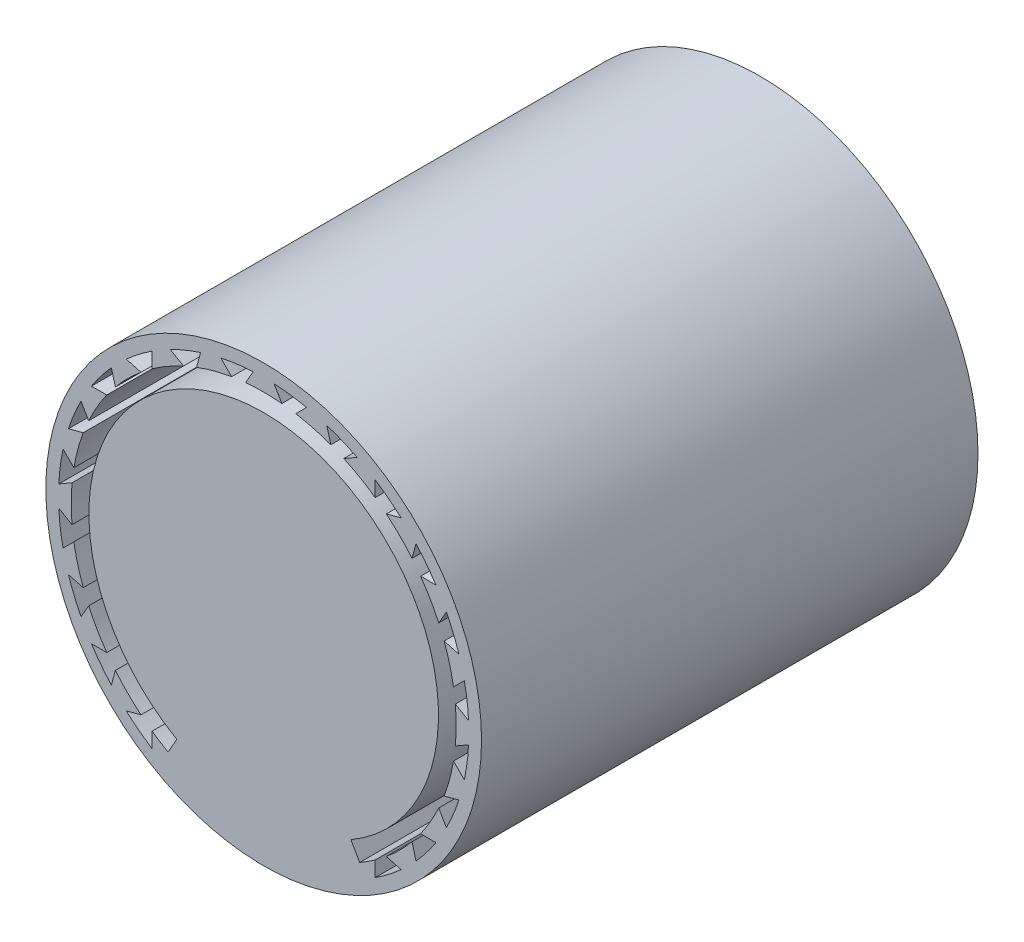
ISO-10303-21;
HEADER;
FILE_DESCRIPTION(('STEP AP214'),'2;1');
FILE_NAME('part.step','',(''),(''),'','','');
FILE_SCHEMA(('AUTOMOTIVE_DESIGN { 1 0 10303 214 1 1 1 1 }'));
ENDSEC;
DATA;
#1=APPLICATION_CONTEXT('core data for automotive mechanical design processes');
#2=APPLICATION_PROTOCOL_DEFINITION('international standard','automotive_design',2000,#1);
#3=PRODUCT_CONTEXT('',#1,'mechanical');
#4=PRODUCT('Part','Part','',(#3));
#5=PRODUCT_RELATED_PRODUCT_CATEGORY('part','',(#4));
#6=PRODUCT_DEFINITION_FORMATION('','',#4);
#7=PRODUCT_DEFINITION_CONTEXT('part definition',#1,'design');
#8=PRODUCT_DEFINITION('design','',#6,#7);
#9=PRODUCT_DEFINITION_SHAPE('','',#8);
#10=(LENGTH_UNIT() NAMED_UNIT(*) SI_UNIT(.MILLI.,.METRE.));
#11=(NAMED_UNIT(*) PLANE_ANGLE_UNIT() SI_UNIT($,.RADIAN.));
#12=(NAMED_UNIT(*) SI_UNIT($,.STERADIAN.) SOLID_ANGLE_UNIT());
#13=UNCERTAINTY_MEASURE_WITH_UNIT(LENGTH_MEASURE(1.E-05),#10,'distance_accuracy_value','');
#14=(GEOMETRIC_REPRESENTATION_CONTEXT(3) GLOBAL_UNCERTAINTY_ASSIGNED_CONTEXT((#13)) GLOBAL_UNIT_ASSIGNED_CONTEXT((#10,
#11,#12)) REPRESENTATION_CONTEXT('',''));
#15=CARTESIAN_POINT('',(0.,0.,0.));
#16=DIRECTION('',(0.,0.,1.));
#17=DIRECTION('',(1.,0.,0.));
#18=AXIS2_PLACEMENT_3D('',#15,#16,#17);
#19=CARTESIAN_POINT('',(0.,0.,-98.));
#20=DIRECTION('',(0.,0.,1.));
#21=DIRECTION('',(1.,0.,0.));
#22=AXIS2_PLACEMENT_3D('',#19,#20,#21);
#23=CYLINDRICAL_SURFACE('',#22,43.);
#24=CARTESIAN_POINT('',(0.,0.,-98.));
#25=DIRECTION('',(0.,0.,1.));
#26=DIRECTION('',(1.,0.,0.));
#27=AXIS2_PLACEMENT_3D('',#24,#25,#26);
#28=CIRCLE('',#27,43.);
#29=CARTESIAN_POINT('',(43.,0.,-98.));
#30=VERTEX_POINT('',#29);
#31=EDGE_CURVE('E11',#30,#30,#28,.T.);
#32=ORIENTED_EDGE('',*,*,#31,.T.);
#33=EDGE_LOOP('',(#32));
#34=FACE_BOUND('',#33,.T.);
#35=CARTESIAN_POINT('',(0.,0.,0.));
#36=DIRECTION('',(0.,0.,1.));
#37=DIRECTION('',(1.,0.,0.));
#38=AXIS2_PLACEMENT_3D('',#35,#36,#37);
#39=CIRCLE('',#38,43.);
#40=CARTESIAN_POINT('',(43.,0.,0.));
#41=VERTEX_POINT('',#40);
#42=EDGE_CURVE('E39',#41,#41,#39,.T.);
#43=ORIENTED_EDGE('',*,*,#42,.F.);
#44=EDGE_LOOP('',(#43));
#45=FACE_BOUND('',#44,.T.);
#46=ADVANCED_FACE('F32',(#34,#45),#23,.T.);
#47=CARTESIAN_POINT('',(0.,0.,-98.));
#48=DIRECTION('',(0.,0.,1.));
#49=DIRECTION('',(1.,0.,0.));
#50=AXIS2_PLACEMENT_3D('',#47,#48,#49);
#51=PLANE('',#50);
#52=DIRECTION('',(-0.707106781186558,-0.707106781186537,0.));
#53=VECTOR('',#52,1.);
#54=CARTESIAN_POINT('',(39.6044558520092,8.46977429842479,-98.));
#55=LINE('',#54,#53);
#56=CARTESIAN_POINT('',(39.6044558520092,8.46977429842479,-98.));
#57=VERTEX_POINT('',#56);
#58=CARTESIAN_POINT('',(37.4684343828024,6.33375282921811,-98.));
#59=VERTEX_POINT('',#58);
#60=EDGE_CURVE('E1062',#57,#59,#55,.T.);
#61=ORIENTED_EDGE('',*,*,#60,.T.);
#62=CARTESIAN_POINT('',(0.,0.,-98.));
#63=DIRECTION('',(0.,0.,1.));
#64=DIRECTION('',(1.,0.,0.));
#65=AXIS2_PLACEMENT_3D('',#62,#63,#64);
#66=CIRCLE('',#65,38.);
#67=CARTESIAN_POINT('',(35.6154924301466,13.2490263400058,-98.));
#68=VERTEX_POINT('',#67);
#69=EDGE_CURVE('E816',#59,#68,#66,.T.);
#70=ORIENTED_EDGE('',*,*,#69,.T.);
#71=DIRECTION('',(0.965925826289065,-0.258819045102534,0.));
#72=VECTOR('',#71,1.);
#73=CARTESIAN_POINT('',(35.6154924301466,13.2490263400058,-98.));
#74=LINE('',#73,#72);
#75=CARTESIAN_POINT('',(38.5333520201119,12.4671882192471,-98.));
#76=VERTEX_POINT('',#75);
#77=EDGE_CURVE('E819',#68,#76,#74,.T.);
#78=ORIENTED_EDGE('',*,*,#77,.T.);
#79=CARTESIAN_POINT('',(0.,0.,-98.));
#80=DIRECTION('',(0.,0.,1.));
#81=DIRECTION('',(1.,0.,0.));
#82=AXIS2_PLACEMENT_3D('',#79,#80,#81);
#83=CIRCLE('',#82,40.5);
#84=CARTESIAN_POINT('',(36.0628278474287,18.4315611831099,-98.));
#85=VERTEX_POINT('',#84);
#86=EDGE_CURVE('E46',#76,#85,#83,.T.);
#87=ORIENTED_EDGE('',*,*,#86,.T.);
#88=DIRECTION('',(-0.500000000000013,-0.866025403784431,0.));
#89=VECTOR('',#88,1.);
#90=CARTESIAN_POINT('',(36.0628278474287,18.4315611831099,-98.));
#91=LINE('',#90,#89);
#92=CARTESIAN_POINT('',(34.5524325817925,15.8154798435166,-98.));
#93=VERTEX_POINT('',#92);
#94=EDGE_CURVE('E822',#85,#93,#91,.T.);
#95=ORIENTED_EDGE('',*,*,#94,.T.);
#96=CARTESIAN_POINT('',(0.,0.,-98.));
#97=DIRECTION('',(0.,0.,1.));
#98=DIRECTION('',(1.,0.,0.));
#99=AXIS2_PLACEMENT_3D('',#96,#97,#98);
#100=CIRCLE('',#99,38.);
#101=CARTESIAN_POINT('',(30.972823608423,22.0155444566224,-98.));
#102=VERTEX_POINT('',#101);
#103=EDGE_CURVE('E825',#93,#102,#100,.T.);
#104=ORIENTED_EDGE('',*,*,#103,.T.);
#105=DIRECTION('',(1.,0.,0.));
#106=VECTOR('',#105,1.);
#107=CARTESIAN_POINT('',(30.972823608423,22.0155444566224,-98.));
#108=LINE('',#107,#106);
#109=CARTESIAN_POINT('',(33.9936141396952,22.0155444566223,-98.));
#110=VERTEX_POINT('',#109);
#111=EDGE_CURVE('E828',#102,#110,#108,.T.);
#112=ORIENTED_EDGE('',*,*,#111,.T.);
#113=CARTESIAN_POINT('',(0.,0.,-98.));
#114=DIRECTION('',(0.,0.,1.));
#115=DIRECTION('',(1.,0.,0.));
#116=AXIS2_PLACEMENT_3D('',#113,#114,#115);
#117=CIRCLE('',#116,40.5);
#118=CARTESIAN_POINT('',(30.0635777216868,27.137267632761,-98.));
#119=VERTEX_POINT('',#118);
#120=EDGE_CURVE('E831',#110,#119,#117,.T.);
#121=ORIENTED_EDGE('',*,*,#120,.T.);
#122=DIRECTION('',(-0.258819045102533,-0.965925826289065,0.));
#123=VECTOR('',#122,1.);
#124=CARTESIAN_POINT('',(30.0635777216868,27.137267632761,-98.));
#125=LINE('',#124,#123);
#126=CARTESIAN_POINT('',(29.2817396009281,24.2194080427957,-98.));
#127=VERTEX_POINT('',#126);
#128=EDGE_CURVE('E834',#119,#127,#125,.T.);
#129=ORIENTED_EDGE('',*,*,#128,.T.);
#130=CARTESIAN_POINT('',(0.,0.,-98.));
#131=DIRECTION('',(0.,0.,1.));
#132=DIRECTION('',(1.,0.,0.));
#133=AXIS2_PLACEMENT_3D('',#130,#131,#132);
#134=CIRCLE('',#133,38.);
#135=CARTESIAN_POINT('',(24.2194080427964,29.2817396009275,-98.));
#136=VERTEX_POINT('',#135);
#137=EDGE_CURVE('E837',#127,#136,#134,.T.);
#138=ORIENTED_EDGE('',*,*,#137,.T.);
#139=DIRECTION('',(0.965925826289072,0.258819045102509,0.));
#140=VECTOR('',#139,1.);
#141=CARTESIAN_POINT('',(24.2194080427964,29.2817396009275,-98.));
#142=LINE('',#141,#140);
#143=CARTESIAN_POINT('',(27.1372676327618,30.0635777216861,-98.));
#144=VERTEX_POINT('',#143);
#145=EDGE_CURVE('E840',#136,#144,#142,.T.);
#146=ORIENTED_EDGE('',*,*,#145,.T.);
#147=CARTESIAN_POINT('',(0.,0.,-98.));
#148=DIRECTION('',(0.,0.,1.));
#149=DIRECTION('',(1.,0.,0.));
#150=AXIS2_PLACEMENT_3D('',#147,#148,#149);
#151=CIRCLE('',#150,40.5);
#152=CARTESIAN_POINT('',(22.0155444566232,33.9936141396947,-98.));
#153=VERTEX_POINT('',#152);
#154=EDGE_CURVE('E843',#144,#153,#151,.T.);
#155=ORIENTED_EDGE('',*,*,#154,.T.);
#156=DIRECTION('',(0.,-1.,0.));
#157=VECTOR('',#156,1.);
#158=CARTESIAN_POINT('',(22.0155444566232,33.9936141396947,-98.));
#159=LINE('',#158,#157);
#160=CARTESIAN_POINT('',(22.0155444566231,30.9728236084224,-98.));
#161=VERTEX_POINT('',#160);
#162=EDGE_CURVE('E846',#153,#161,#159,.T.);
#163=ORIENTED_EDGE('',*,*,#162,.T.);
#164=CARTESIAN_POINT('',(0.,0.,-98.));
#165=DIRECTION('',(0.,0.,1.));
#166=DIRECTION('',(1.,0.,0.));
#167=AXIS2_PLACEMENT_3D('',#164,#165,#166);
#168=CIRCLE('',#167,38.);
#169=CARTESIAN_POINT('',(15.8154798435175,34.5524325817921,-98.));
#170=VERTEX_POINT('',#169);
#171=EDGE_CURVE('E849',#161,#170,#168,.T.);
#172=ORIENTED_EDGE('',*,*,#171,.T.);
#173=DIRECTION('',(0.866025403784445,0.499999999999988,0.));
#174=VECTOR('',#173,1.);
#175=CARTESIAN_POINT('',(15.8154798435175,34.5524325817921,-98.));
#176=LINE('',#175,#174);
#177=CARTESIAN_POINT('',(18.4315611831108,36.0628278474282,-98.));
#178=VERTEX_POINT('',#177);
#179=EDGE_CURVE('E852',#170,#178,#176,.T.);
#180=ORIENTED_EDGE('',*,*,#179,.T.);
#181=CARTESIAN_POINT('',(0.,0.,-98.));
#182=DIRECTION('',(0.,0.,1.));
#183=DIRECTION('',(1.,0.,0.));
#184=AXIS2_PLACEMENT_3D('',#181,#182,#183);
#185=CIRCLE('',#184,40.5);
#186=CARTESIAN_POINT('',(12.4671882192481,38.5333520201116,-98.));
#187=VERTEX_POINT('',#186);
#188=EDGE_CURVE('E855',#178,#187,#185,.T.);
#189=ORIENTED_EDGE('',*,*,#188,.T.);
#190=DIRECTION('',(0.258819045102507,-0.965925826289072,0.));
#191=VECTOR('',#190,1.);
#192=CARTESIAN_POINT('',(12.4671882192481,38.5333520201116,-98.));
#193=LINE('',#192,#191);
#194=CARTESIAN_POINT('',(13.2490263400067,35.6154924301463,-98.));
#195=VERTEX_POINT('',#194);
#196=EDGE_CURVE('E858',#187,#195,#193,.T.);
#197=ORIENTED_EDGE('',*,*,#196,.T.);
#198=CARTESIAN_POINT('',(0.,0.,-98.));
#199=DIRECTION('',(0.,0.,1.));
#200=DIRECTION('',(1.,0.,0.));
#201=AXIS2_PLACEMENT_3D('',#198,#199,#200);
#202=CIRCLE('',#201,38.);
#203=CARTESIAN_POINT('',(6.33375282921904,37.4684343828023,-98.));
#204=VERTEX_POINT('',#203);
#205=EDGE_CURVE('E861',#195,#204,#202,.T.);
#206=ORIENTED_EDGE('',*,*,#205,.T.);
#207=DIRECTION('',(0.707106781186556,0.707106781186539,0.));
#208=VECTOR('',#207,1.);
#209=CARTESIAN_POINT('',(6.33375282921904,37.4684343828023,-98.));
#210=LINE('',#209,#208);
#211=CARTESIAN_POINT('',(8.46977429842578,39.604455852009,-98.));
#212=VERTEX_POINT('',#211);
#213=EDGE_CURVE('E864',#204,#212,#210,.T.);
#214=ORIENTED_EDGE('',*,*,#213,.T.);
#215=CARTESIAN_POINT('',(0.,0.,-98.));
#216=DIRECTION('',(0.,0.,1.));
#217=DIRECTION('',(1.,0.,0.));
#218=AXIS2_PLACEMENT_3D('',#215,#216,#217);
#219=CIRCLE('',#218,40.5);
#220=CARTESIAN_POINT('',(2.06921370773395,40.4471056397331,-98.));
#221=VERTEX_POINT('',#220);
#222=EDGE_CURVE('E867',#212,#221,#219,.T.);
#223=ORIENTED_EDGE('',*,*,#222,.T.);
#224=DIRECTION('',(0.499999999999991,-0.866025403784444,0.));
#225=VECTOR('',#224,1.);
#226=CARTESIAN_POINT('',(2.06921370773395,40.4471056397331,-98.));
#227=LINE('',#226,#225);
#228=CARTESIAN_POINT('',(3.57960897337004,37.8310243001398,-98.));
#229=VERTEX_POINT('',#228);
#230=EDGE_CURVE('E870',#221,#229,#227,.T.);
#231=ORIENTED_EDGE('',*,*,#230,.T.);
#232=CARTESIAN_POINT('',(0.,0.,-98.));
#233=DIRECTION('',(0.,0.,1.));
#234=DIRECTION('',(1.,0.,0.));
#235=AXIS2_PLACEMENT_3D('',#232,#233,#234);
#236=CIRCLE('',#235,38.);
#237=CARTESIAN_POINT('',(-3.57960897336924,37.8310243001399,-98.));
#238=VERTEX_POINT('',#237);
#239=EDGE_CURVE('E873',#229,#238,#236,.T.);
#240=ORIENTED_EDGE('',*,*,#239,.T.);
#241=DIRECTION('',(0.500000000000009,0.866025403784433,0.));
#242=VECTOR('',#241,1.);
#243=CARTESIAN_POINT('',(-3.57960897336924,37.8310243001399,-98.));
#244=LINE('',#243,#242);
#245=CARTESIAN_POINT('',(-2.0692137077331,40.4471056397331,-98.));
#246=VERTEX_POINT('',#245);
#247=EDGE_CURVE('E876',#238,#246,#244,.T.);
#248=ORIENTED_EDGE('',*,*,#247,.T.);
#249=CARTESIAN_POINT('',(0.,0.,-98.));
#250=DIRECTION('',(0.,0.,1.));
#251=DIRECTION('',(1.,0.,0.));
#252=AXIS2_PLACEMENT_3D('',#249,#250,#251);
#253=CIRCLE('',#252,40.5);
#254=CARTESIAN_POINT('',(-8.46977429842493,39.6044558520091,-98.));
#255=VERTEX_POINT('',#254);
#256=EDGE_CURVE('E879',#246,#255,#253,.T.);
#257=ORIENTED_EDGE('',*,*,#256,.T.);
#258=DIRECTION('',(0.707106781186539,-0.707106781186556,0.));
#259=VECTOR('',#258,1.);
#260=CARTESIAN_POINT('',(-8.46977429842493,39.6044558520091,-98.));
#261=LINE('',#260,#259);
#262=CARTESIAN_POINT('',(-6.33375282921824,37.4684343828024,-98.));
#263=VERTEX_POINT('',#262);
#264=EDGE_CURVE('E882',#255,#263,#261,.T.);
#265=ORIENTED_EDGE('',*,*,#264,.T.);
#266=CARTESIAN_POINT('',(0.,0.,-98.));
#267=DIRECTION('',(0.,0.,1.));
#268=DIRECTION('',(1.,0.,0.));
#269=AXIS2_PLACEMENT_3D('',#266,#267,#268);
#270=CIRCLE('',#269,38.);
#271=CARTESIAN_POINT('',(-13.2490263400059,35.6154924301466,-98.));
#272=VERTEX_POINT('',#271);
#273=EDGE_CURVE('E885',#263,#272,#270,.T.);
#274=ORIENTED_EDGE('',*,*,#273,.T.);
#275=DIRECTION('',(0.258819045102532,0.965925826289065,0.));
#276=VECTOR('',#275,1.);
#277=CARTESIAN_POINT('',(-13.2490263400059,35.6154924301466,-98.));
#278=LINE('',#277,#276);
#279=CARTESIAN_POINT('',(-12.4671882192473,38.5333520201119,-98.));
#280=VERTEX_POINT('',#279);
#281=EDGE_CURVE('E888',#272,#280,#278,.T.);
#282=ORIENTED_EDGE('',*,*,#281,.T.);
#283=CARTESIAN_POINT('',(0.,0.,-98.));
#284=DIRECTION('',(0.,0.,1.));
#285=DIRECTION('',(1.,0.,0.));
#286=AXIS2_PLACEMENT_3D('',#283,#284,#285);
#287=CIRCLE('',#286,40.5);
#288=CARTESIAN_POINT('',(-18.43156118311,36.0628278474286,-98.));
#289=VERTEX_POINT('',#288);
#290=EDGE_CURVE('E891',#280,#289,#287,.T.);
#291=ORIENTED_EDGE('',*,*,#290,.T.);
#292=DIRECTION('',(0.866025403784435,-0.500000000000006,0.));
#293=VECTOR('',#292,1.);
#294=CARTESIAN_POINT('',(-18.43156118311,36.0628278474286,-98.));
#295=LINE('',#294,#293);
#296=CARTESIAN_POINT('',(-15.8154798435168,34.5524325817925,-98.));
#297=VERTEX_POINT('',#296);
#298=EDGE_CURVE('E894',#289,#297,#295,.T.);
#299=ORIENTED_EDGE('',*,*,#298,.T.);
#300=CARTESIAN_POINT('',(0.,0.,-98.));
#301=DIRECTION('',(0.,0.,1.));
#302=DIRECTION('',(1.,0.,0.));
#303=AXIS2_PLACEMENT_3D('',#300,#301,#302);
#304=CIRCLE('',#303,38.);
#305=CARTESIAN_POINT('',(-22.0155444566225,30.9728236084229,-98.));
#306=VERTEX_POINT('',#305);
#307=EDGE_CURVE('E897',#297,#306,#304,.T.);
#308=ORIENTED_EDGE('',*,*,#307,.T.);
#309=DIRECTION('',(0.,1.,0.));
#310=VECTOR('',#309,1.);
#311=CARTESIAN_POINT('',(-22.0155444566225,30.9728236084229,-98.));
#312=LINE('',#311,#310);
#313=CARTESIAN_POINT('',(-22.0155444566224,33.9936141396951,-98.));
#314=VERTEX_POINT('',#313);
#315=EDGE_CURVE('E900',#306,#314,#312,.T.);
#316=ORIENTED_EDGE('',*,*,#315,.T.);
#317=CARTESIAN_POINT('',(0.,0.,-98.));
#318=DIRECTION('',(0.,0.,1.));
#319=DIRECTION('',(1.,0.,0.));
#320=AXIS2_PLACEMENT_3D('',#317,#318,#319);
#321=CIRCLE('',#320,40.5);
#322=CARTESIAN_POINT('',(-27.1372676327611,30.0635777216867,-98.));
#323=VERTEX_POINT('',#322);
#324=EDGE_CURVE('E903',#314,#323,#321,.T.);
#325=ORIENTED_EDGE('',*,*,#324,.T.);
#326=DIRECTION('',(0.965925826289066,-0.258819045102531,0.));
#327=VECTOR('',#326,1.);
#328=CARTESIAN_POINT('',(-27.1372676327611,30.0635777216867,-98.));
#329=LINE('',#328,#327);
#330=CARTESIAN_POINT('',(-24.2194080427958,29.281739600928,-98.));
#331=VERTEX_POINT('',#330);
#332=EDGE_CURVE('E906',#323,#331,#329,.T.);
#333=ORIENTED_EDGE('',*,*,#332,.T.);
#334=CARTESIAN_POINT('',(0.,0.,-98.));
#335=DIRECTION('',(0.,0.,1.));
#336=DIRECTION('',(1.,0.,0.));
#337=AXIS2_PLACEMENT_3D('',#334,#335,#336);
#338=CIRCLE('',#337,38.);
#339=CARTESIAN_POINT('',(-29.2817396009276,24.2194080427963,-98.));
#340=VERTEX_POINT('',#339);
#341=EDGE_CURVE('E909',#331,#340,#338,.T.);
#342=ORIENTED_EDGE('',*,*,#341,.T.);
#343=DIRECTION('',(-0.258819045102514,0.96592582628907,0.));
#344=VECTOR('',#343,1.);
#345=CARTESIAN_POINT('',(-29.2817396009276,24.2194080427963,-98.));
#346=LINE('',#345,#344);
#347=CARTESIAN_POINT('',(-30.0635777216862,27.1372676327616,-98.));
#348=VERTEX_POINT('',#347);
#349=EDGE_CURVE('E912',#340,#348,#346,.T.);
#350=ORIENTED_EDGE('',*,*,#349,.T.);
#351=CARTESIAN_POINT('',(0.,0.,-98.));
#352=DIRECTION('',(0.,0.,1.));
#353=DIRECTION('',(1.,0.,0.));
#354=AXIS2_PLACEMENT_3D('',#351,#352,#353);
#355=CIRCLE('',#354,40.5);
#356=CARTESIAN_POINT('',(-33.9936141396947,22.0155444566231,-98.));
#357=VERTEX_POINT('',#356);
#358=EDGE_CURVE('E915',#348,#357,#355,.T.);
#359=ORIENTED_EDGE('',*,*,#358,.T.);
#360=DIRECTION('',(1.,0.,0.));
#361=VECTOR('',#360,1.);
#362=CARTESIAN_POINT('',(-33.9936141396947,22.0155444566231,-98.));
#363=LINE('',#362,#361);
#364=CARTESIAN_POINT('',(-30.9728236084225,22.015544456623,-98.));
#365=VERTEX_POINT('',#364);
#366=EDGE_CURVE('E918',#357,#365,#363,.T.);
#367=ORIENTED_EDGE('',*,*,#366,.T.);
#368=CARTESIAN_POINT('',(0.,0.,-98.));
#369=DIRECTION('',(0.,0.,1.));
#370=DIRECTION('',(1.,0.,0.));
#371=AXIS2_PLACEMENT_3D('',#368,#369,#370);
#372=CIRCLE('',#371,38.);
#373=CARTESIAN_POINT('',(-34.5524325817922,15.8154798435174,-98.));
#374=VERTEX_POINT('',#373);
#375=EDGE_CURVE('E921',#365,#374,#372,.T.);
#376=ORIENTED_EDGE('',*,*,#375,.T.);
#377=DIRECTION('',(-0.499999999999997,0.86602540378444,0.));
#378=VECTOR('',#377,1.);
#379=CARTESIAN_POINT('',(-34.5524325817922,15.8154798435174,-98.));
#380=LINE('',#379,#378);
#381=CARTESIAN_POINT('',(-36.0628278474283,18.4315611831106,-98.));
#382=VERTEX_POINT('',#381);
#383=EDGE_CURVE('E924',#374,#382,#380,.T.);
#384=ORIENTED_EDGE('',*,*,#383,.T.);
#385=CARTESIAN_POINT('',(0.,0.,-98.));
#386=DIRECTION('',(0.,0.,1.));
#387=DIRECTION('',(1.,0.,0.));
#388=AXIS2_PLACEMENT_3D('',#385,#386,#387);
#389=CIRCLE('',#388,40.5);
#390=CARTESIAN_POINT('',(-38.5333520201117,12.467188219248,-98.));
#391=VERTEX_POINT('',#390);
#392=EDGE_CURVE('E927',#382,#391,#389,.T.);
#393=ORIENTED_EDGE('',*,*,#392,.T.);
#394=DIRECTION('',(0.96592582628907,0.258819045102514,0.));
#395=VECTOR('',#394,1.);
#396=CARTESIAN_POINT('',(-38.5333520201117,12.467188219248,-98.));
#397=LINE('',#396,#395);
#398=CARTESIAN_POINT('',(-35.6154924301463,13.2490263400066,-98.));
#399=VERTEX_POINT('',#398);
#400=EDGE_CURVE('E930',#391,#399,#397,.T.);
#401=ORIENTED_EDGE('',*,*,#400,.T.);
#402=CARTESIAN_POINT('',(0.,0.,-98.));
#403=DIRECTION('',(0.,0.,1.));
#404=DIRECTION('',(1.,0.,0.));
#405=AXIS2_PLACEMENT_3D('',#402,#403,#404);
#406=CIRCLE('',#405,38.);
#407=CARTESIAN_POINT('',(-37.4684343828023,6.3337528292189,-98.));
#408=VERTEX_POINT('',#407);
#409=EDGE_CURVE('E933',#399,#408,#406,.T.);
#410=ORIENTED_EDGE('',*,*,#409,.T.);
#411=DIRECTION('',(-0.707106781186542,0.707106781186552,0.));
#412=VECTOR('',#411,1.);
#413=CARTESIAN_POINT('',(-37.4684343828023,6.3337528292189,-98.));
#414=LINE('',#413,#412);
#415=CARTESIAN_POINT('',(-39.604455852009,8.46977429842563,-98.));
#416=VERTEX_POINT('',#415);
#417=EDGE_CURVE('E936',#408,#416,#414,.T.);
#418=ORIENTED_EDGE('',*,*,#417,.T.);
#419=CARTESIAN_POINT('',(0.,0.,-98.));
#420=DIRECTION('',(0.,0.,1.));
#421=DIRECTION('',(1.,0.,0.));
#422=AXIS2_PLACEMENT_3D('',#419,#420,#421);
#423=CIRCLE('',#422,40.5);
#424=CARTESIAN_POINT('',(-40.4471056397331,2.06921370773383,-98.));
#425=VERTEX_POINT('',#424);
#426=EDGE_CURVE('E939',#416,#425,#423,.T.);
#427=ORIENTED_EDGE('',*,*,#426,.T.);
#428=DIRECTION('',(0.866025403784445,0.49999999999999,0.));
#429=VECTOR('',#428,1.);
#430=CARTESIAN_POINT('',(-40.4471056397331,2.06921370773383,-98.));
#431=LINE('',#430,#429);
#432=CARTESIAN_POINT('',(-37.8310243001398,3.57960897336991,-98.));
#433=VERTEX_POINT('',#432);
#434=EDGE_CURVE('E942',#425,#433,#431,.T.);
#435=ORIENTED_EDGE('',*,*,#434,.T.);
#436=CARTESIAN_POINT('',(0.,0.,-98.));
#437=DIRECTION('',(0.,0.,1.));
#438=DIRECTION('',(1.,0.,0.));
#439=AXIS2_PLACEMENT_3D('',#436,#437,#438);
#440=CIRCLE('',#439,38.);
#441=CARTESIAN_POINT('',(-37.8310243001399,-3.57960897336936,-98.));
#442=VERTEX_POINT('',#441);
#443=EDGE_CURVE('E945',#433,#442,#440,.T.);
#444=ORIENTED_EDGE('',*,*,#443,.T.);
#445=DIRECTION('',(-0.866025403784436,0.500000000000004,0.));
#446=VECTOR('',#445,1.);
#447=CARTESIAN_POINT('',(-37.8310243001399,-3.57960897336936,-98.));
#448=LINE('',#447,#446);
#449=CARTESIAN_POINT('',(-40.4471056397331,-2.06921370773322,-98.));
#450=VERTEX_POINT('',#449);
#451=EDGE_CURVE('E948',#442,#450,#448,.T.);
#452=ORIENTED_EDGE('',*,*,#451,.T.);
#453=CARTESIAN_POINT('',(0.,0.,-98.));
#454=DIRECTION('',(0.,0.,1.));
#455=DIRECTION('',(1.,0.,0.));
#456=AXIS2_PLACEMENT_3D('',#453,#454,#455);
#457=CIRCLE('',#456,40.5);
#458=CARTESIAN_POINT('',(-39.6044558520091,-8.46977429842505,-98.));
#459=VERTEX_POINT('',#458);
#460=EDGE_CURVE('E951',#450,#459,#457,.T.);
#461=ORIENTED_EDGE('',*,*,#460,.T.);
#462=DIRECTION('',(0.707106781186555,0.70710678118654,0.));
#463=VECTOR('',#462,1.);
#464=CARTESIAN_POINT('',(-39.6044558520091,-8.46977429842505,-98.));
#465=LINE('',#464,#463);
#466=CARTESIAN_POINT('',(-37.4684343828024,-6.33375282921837,-98.));
#467=VERTEX_POINT('',#466);
#468=EDGE_CURVE('E954',#459,#467,#465,.T.);
#469=ORIENTED_EDGE('',*,*,#468,.T.);
#470=CARTESIAN_POINT('',(0.,0.,-98.));
#471=DIRECTION('',(0.,0.,1.));
#472=DIRECTION('',(1.,0.,0.));
#473=AXIS2_PLACEMENT_3D('',#470,#471,#472);
#474=CIRCLE('',#473,38.);
#475=CARTESIAN_POINT('',(-35.6154924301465,-13.249026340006,-98.));
#476=VERTEX_POINT('',#475);
#477=EDGE_CURVE('E957',#467,#476,#474,.T.);
#478=ORIENTED_EDGE('',*,*,#477,.T.);
#479=DIRECTION('',(-0.965925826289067,0.258819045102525,0.));
#480=VECTOR('',#479,1.);
#481=CARTESIAN_POINT('',(-35.6154924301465,-13.249026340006,-98.));
#482=LINE('',#481,#480);
#483=CARTESIAN_POINT('',(-38.5333520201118,-12.4671882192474,-98.));
#484=VERTEX_POINT('',#483);
#485=EDGE_CURVE('E960',#476,#484,#482,.T.);
#486=ORIENTED_EDGE('',*,*,#485,.T.);
#487=CARTESIAN_POINT('',(0.,0.,-98.));
#488=DIRECTION('',(0.,0.,1.));
#489=DIRECTION('',(1.,0.,0.));
#490=AXIS2_PLACEMENT_3D('',#487,#488,#489);
#491=CIRCLE('',#490,40.5);
#492=CARTESIAN_POINT('',(-36.0628278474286,-18.4315611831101,-98.));
#493=VERTEX_POINT('',#492);
#494=EDGE_CURVE('E963',#484,#493,#491,.T.);
#495=ORIENTED_EDGE('',*,*,#494,.T.);
#496=DIRECTION('',(0.50000000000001,0.866025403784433,0.));
#497=VECTOR('',#496,1.);
#498=CARTESIAN_POINT('',(-36.0628278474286,-18.4315611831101,-98.));
#499=LINE('',#498,#497);
#500=CARTESIAN_POINT('',(-34.5524325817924,-15.8154798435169,-98.));
#501=VERTEX_POINT('',#500);
#502=EDGE_CURVE('E966',#493,#501,#499,.T.);
#503=ORIENTED_EDGE('',*,*,#502,.T.);
#504=CARTESIAN_POINT('',(0.,0.,-98.));
#505=DIRECTION('',(0.,0.,1.));
#506=DIRECTION('',(1.,0.,0.));
#507=AXIS2_PLACEMENT_3D('',#504,#505,#506);
#508=CIRCLE('',#507,38.);
#509=CARTESIAN_POINT('',(-30.9728236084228,-22.0155444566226,-98.));
#510=VERTEX_POINT('',#509);
#511=EDGE_CURVE('E969',#501,#510,#508,.T.);
#512=ORIENTED_EDGE('',*,*,#511,.T.);
#513=DIRECTION('',(-1.,0.,0.));
#514=VECTOR('',#513,1.);
#515=CARTESIAN_POINT('',(-30.9728236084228,-22.0155444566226,-98.));
#516=LINE('',#515,#514);
#517=CARTESIAN_POINT('',(-33.993614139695,-22.0155444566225,-98.));
#518=VERTEX_POINT('',#517);
#519=EDGE_CURVE('E972',#510,#518,#516,.T.);
#520=ORIENTED_EDGE('',*,*,#519,.T.);
#521=CARTESIAN_POINT('',(0.,0.,-98.));
#522=DIRECTION('',(0.,0.,1.));
#523=DIRECTION('',(1.,0.,0.));
#524=AXIS2_PLACEMENT_3D('',#521,#522,#523);
#525=CIRCLE('',#524,40.5);
#526=CARTESIAN_POINT('',(-30.0635777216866,-27.1372676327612,-98.));
#527=VERTEX_POINT('',#526);
#528=EDGE_CURVE('E975',#518,#527,#525,.T.);
#529=ORIENTED_EDGE('',*,*,#528,.T.);
#530=DIRECTION('',(0.25881904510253,0.965925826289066,0.));
#531=VECTOR('',#530,1.);
#532=CARTESIAN_POINT('',(-30.0635777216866,-27.1372676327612,-98.));
#533=LINE('',#532,#531);
#534=CARTESIAN_POINT('',(-29.281739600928,-24.2194080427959,-98.));
#535=VERTEX_POINT('',#534);
#536=EDGE_CURVE('E978',#527,#535,#533,.T.);
#537=ORIENTED_EDGE('',*,*,#536,.T.);
#538=CARTESIAN_POINT('',(0.,0.,-98.));
#539=DIRECTION('',(0.,0.,1.));
#540=DIRECTION('',(1.,0.,0.));
#541=AXIS2_PLACEMENT_3D('',#538,#539,#540);
#542=CIRCLE('',#541,38.);
#543=CARTESIAN_POINT('',(-24.2194080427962,-29.2817396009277,-98.));
#544=VERTEX_POINT('',#543);
#545=EDGE_CURVE('E981',#535,#544,#542,.T.);
#546=ORIENTED_EDGE('',*,*,#545,.T.);
#547=DIRECTION('',(-0.96592582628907,-0.258819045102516,0.));
#548=VECTOR('',#547,1.);
#549=CARTESIAN_POINT('',(-24.2194080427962,-29.2817396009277,-98.));
#550=LINE('',#549,#548);
#551=CARTESIAN_POINT('',(-27.1372676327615,-30.0635777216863,-98.));
#552=VERTEX_POINT('',#551);
#553=EDGE_CURVE('E984',#544,#552,#550,.T.);
#554=ORIENTED_EDGE('',*,*,#553,.T.);
#555=CARTESIAN_POINT('',(0.,0.,-98.));
#556=DIRECTION('',(0.,0.,1.));
#557=DIRECTION('',(1.,0.,0.));
#558=AXIS2_PLACEMENT_3D('',#555,#556,#557);
#559=CIRCLE('',#558,40.5);
#560=CARTESIAN_POINT('',(-22.0155444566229,-33.9936141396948,-98.));
#561=VERTEX_POINT('',#560);
#562=EDGE_CURVE('E987',#552,#561,#559,.T.);
#563=ORIENTED_EDGE('',*,*,#562,.T.);
#564=DIRECTION('',(0.,1.,0.));
#565=VECTOR('',#564,1.);
#566=CARTESIAN_POINT('',(-22.0155444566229,-33.9936141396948,-98.));
#567=LINE('',#566,#565);
#568=CARTESIAN_POINT('',(-22.0155444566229,-30.9728236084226,-98.));
#569=VERTEX_POINT('',#568);
#570=EDGE_CURVE('E990',#561,#569,#567,.T.);
#571=ORIENTED_EDGE('',*,*,#570,.T.);
#572=CARTESIAN_POINT('',(0.,0.,-98.));
#573=DIRECTION('',(0.,0.,1.));
#574=DIRECTION('',(1.,0.,0.));
#575=AXIS2_PLACEMENT_3D('',#572,#573,#574);
#576=CIRCLE('',#575,38.);
#577=CARTESIAN_POINT('',(-18.8849531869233,-32.97512006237,-98.));
#578=VERTEX_POINT('',#577);
#579=EDGE_CURVE('E993',#569,#578,#576,.T.);
#580=ORIENTED_EDGE('',*,*,#579,.T.);
#581=DIRECTION('',(0.496972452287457,0.867766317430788,0.));
#582=VECTOR('',#581,1.);
#583=CARTESIAN_POINT('',(-18.8849531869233,-32.97512006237,-98.));
#584=LINE('',#583,#582);
#585=CARTESIAN_POINT('',(-17.1455496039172,-29.9379379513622,-98.));
#586=VERTEX_POINT('',#585);
#587=EDGE_CURVE('E996',#578,#586,#584,.T.);
#588=ORIENTED_EDGE('',*,*,#587,.T.);
#589=CARTESIAN_POINT('',(0.,0.,-98.));
#590=DIRECTION('',(0.,0.,-1.));
#591=DIRECTION('',(1.,0.,0.));
#592=AXIS2_PLACEMENT_3D('',#589,#590,#591);
#593=CIRCLE('',#592,34.5);
#594=CARTESIAN_POINT('',(17.2078901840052,-29.9021490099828,-98.));
#595=VERTEX_POINT('',#594);
#596=EDGE_CURVE('E999',#586,#595,#593,.T.);
#597=ORIENTED_EDGE('',*,*,#596,.T.);
#598=DIRECTION('',(0.498779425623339,-0.866728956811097,0.));
#599=VECTOR('',#598,1.);
#600=CARTESIAN_POINT('',(17.2078901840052,-29.9021490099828,-98.));
#601=LINE('',#600,#599);
#602=CARTESIAN_POINT('',(18.9536181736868,-32.9357003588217,-98.));
#603=VERTEX_POINT('',#602);
#604=EDGE_CURVE('E1002',#595,#603,#601,.T.);
#605=ORIENTED_EDGE('',*,*,#604,.T.);
#606=CARTESIAN_POINT('',(0.,0.,-98.));
#607=DIRECTION('',(0.,0.,1.));
#608=DIRECTION('',(1.,0.,0.));
#609=AXIS2_PLACEMENT_3D('',#606,#607,#608);
#610=CIRCLE('',#609,38.);
#611=CARTESIAN_POINT('',(22.0155444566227,-30.9728236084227,-98.));
#612=VERTEX_POINT('',#611);
#613=EDGE_CURVE('E1005',#603,#612,#610,.T.);
#614=ORIENTED_EDGE('',*,*,#613,.T.);
#615=DIRECTION('',(0.,-1.,0.));
#616=VECTOR('',#615,1.);
#617=CARTESIAN_POINT('',(22.0155444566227,-30.9728236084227,-98.));
#618=LINE('',#617,#616);
#619=CARTESIAN_POINT('',(22.0155444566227,-33.993614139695,-98.));
#620=VERTEX_POINT('',#619);
#621=EDGE_CURVE('E1008',#612,#620,#618,.T.);
#622=ORIENTED_EDGE('',*,*,#621,.T.);
#623=CARTESIAN_POINT('',(0.,0.,-98.));
#624=DIRECTION('',(0.,0.,1.));
#625=DIRECTION('',(1.,0.,0.));
#626=AXIS2_PLACEMENT_3D('',#623,#624,#625);
#627=CIRCLE('',#626,40.5);
#628=CARTESIAN_POINT('',(27.1372676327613,-30.0635777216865,-98.));
#629=VERTEX_POINT('',#628);
#630=EDGE_CURVE('E1011',#620,#629,#627,.T.);
#631=ORIENTED_EDGE('',*,*,#630,.T.);
#632=DIRECTION('',(-0.965925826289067,0.258819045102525,0.));
#633=VECTOR('',#632,1.);
#634=CARTESIAN_POINT('',(27.1372676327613,-30.0635777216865,-98.));
#635=LINE('',#634,#633);
#636=CARTESIAN_POINT('',(24.219408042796,-29.2817396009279,-98.));
#637=VERTEX_POINT('',#636);
#638=EDGE_CURVE('E1014',#629,#637,#635,.T.);
#639=ORIENTED_EDGE('',*,*,#638,.T.);
#640=CARTESIAN_POINT('',(0.,0.,-98.));
#641=DIRECTION('',(0.,0.,1.));
#642=DIRECTION('',(1.,0.,0.));
#643=AXIS2_PLACEMENT_3D('',#640,#641,#642);
#644=CIRCLE('',#643,38.);
#645=CARTESIAN_POINT('',(29.2817396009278,-24.2194080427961,-98.));
#646=VERTEX_POINT('',#645);
#647=EDGE_CURVE('E1017',#637,#646,#644,.T.);
#648=ORIENTED_EDGE('',*,*,#647,.T.);
#649=DIRECTION('',(0.258819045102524,-0.965925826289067,0.));
#650=VECTOR('',#649,1.);
#651=CARTESIAN_POINT('',(29.2817396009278,-24.2194080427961,-98.));
#652=LINE('',#651,#650);
#653=CARTESIAN_POINT('',(30.0635777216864,-27.1372676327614,-98.));
#654=VERTEX_POINT('',#653);
#655=EDGE_CURVE('E1020',#646,#654,#652,.T.);
#656=ORIENTED_EDGE('',*,*,#655,.T.);
#657=CARTESIAN_POINT('',(0.,0.,-98.));
#658=DIRECTION('',(0.,0.,1.));
#659=DIRECTION('',(1.,0.,0.));
#660=AXIS2_PLACEMENT_3D('',#657,#658,#659);
#661=CIRCLE('',#660,40.5);
#662=CARTESIAN_POINT('',(33.9936141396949,-22.0155444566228,-98.));
#663=VERTEX_POINT('',#662);
#664=EDGE_CURVE('E1023',#654,#663,#661,.T.);
#665=ORIENTED_EDGE('',*,*,#664,.T.);
#666=DIRECTION('',(-1.,0.,0.));
#667=VECTOR('',#666,1.);
#668=CARTESIAN_POINT('',(33.9936141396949,-22.0155444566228,-98.));
#669=LINE('',#668,#667);
#670=CARTESIAN_POINT('',(30.9728236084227,-22.0155444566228,-98.));
#671=VERTEX_POINT('',#670);
#672=EDGE_CURVE('E1026',#663,#671,#669,.T.);
#673=ORIENTED_EDGE('',*,*,#672,.T.);
#674=CARTESIAN_POINT('',(0.,0.,-98.));
#675=DIRECTION('',(0.,0.,1.));
#676=DIRECTION('',(1.,0.,0.));
#677=AXIS2_PLACEMENT_3D('',#674,#675,#676);
#678=CIRCLE('',#677,38.);
#679=CARTESIAN_POINT('',(34.5524325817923,-15.8154798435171,-98.));
#680=VERTEX_POINT('',#679);
#681=EDGE_CURVE('E1029',#671,#680,#678,.T.);
#682=ORIENTED_EDGE('',*,*,#681,.T.);
#683=DIRECTION('',(0.500000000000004,-0.866025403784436,0.));
#684=VECTOR('',#683,1.);
#685=CARTESIAN_POINT('',(34.5524325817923,-15.8154798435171,-98.));
#686=LINE('',#685,#684);
#687=CARTESIAN_POINT('',(36.0628278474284,-18.4315611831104,-98.));
#688=VERTEX_POINT('',#687);
#689=EDGE_CURVE('E1032',#680,#688,#686,.T.);
#690=ORIENTED_EDGE('',*,*,#689,.T.);
#691=CARTESIAN_POINT('',(0.,0.,-98.));
#692=DIRECTION('',(0.,0.,1.));
#693=DIRECTION('',(1.,0.,0.));
#694=AXIS2_PLACEMENT_3D('',#691,#692,#693);
#695=CIRCLE('',#694,40.5);
#696=CARTESIAN_POINT('',(38.5333520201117,-12.4671882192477,-98.));
#697=VERTEX_POINT('',#696);
#698=EDGE_CURVE('E1035',#688,#697,#695,.T.);
#699=ORIENTED_EDGE('',*,*,#698,.T.);
#700=DIRECTION('',(-0.965925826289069,-0.258819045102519,0.));
#701=VECTOR('',#700,1.);
#702=CARTESIAN_POINT('',(38.5333520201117,-12.4671882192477,-98.));
#703=LINE('',#702,#701);
#704=CARTESIAN_POINT('',(35.6154924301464,-13.2490263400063,-98.));
#705=VERTEX_POINT('',#704);
#706=EDGE_CURVE('E1038',#697,#705,#703,.T.);
#707=ORIENTED_EDGE('',*,*,#706,.T.);
#708=CARTESIAN_POINT('',(0.,0.,-98.));
#709=DIRECTION('',(0.,0.,1.));
#710=DIRECTION('',(1.,0.,0.));
#711=AXIS2_PLACEMENT_3D('',#708,#709,#710);
#712=CIRCLE('',#711,38.);
#713=CARTESIAN_POINT('',(37.4684343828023,-6.33375282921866,-98.));
#714=VERTEX_POINT('',#713);
#715=EDGE_CURVE('E1041',#705,#714,#712,.T.);
#716=ORIENTED_EDGE('',*,*,#715,.T.);
#717=DIRECTION('',(0.707106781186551,-0.707106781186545,0.));
#718=VECTOR('',#717,1.);
#719=CARTESIAN_POINT('',(37.4684343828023,-6.33375282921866,-98.));
#720=LINE('',#719,#718);
#721=CARTESIAN_POINT('',(39.604455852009,-8.46977429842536,-98.));
#722=VERTEX_POINT('',#721);
#723=EDGE_CURVE('E1044',#714,#722,#720,.T.);
#724=ORIENTED_EDGE('',*,*,#723,.T.);
#725=CARTESIAN_POINT('',(0.,0.,-98.));
#726=DIRECTION('',(0.,0.,1.));
#727=DIRECTION('',(1.,0.,0.));
#728=AXIS2_PLACEMENT_3D('',#725,#726,#727);
#729=CIRCLE('',#728,40.5);
#730=CARTESIAN_POINT('',(40.4471056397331,-2.06921370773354,-98.));
#731=VERTEX_POINT('',#730);
#732=EDGE_CURVE('E1047',#722,#731,#729,.T.);
#733=ORIENTED_EDGE('',*,*,#732,.T.);
#734=DIRECTION('',(-0.86602540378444,-0.499999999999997,0.));
#735=VECTOR('',#734,1.);
#736=CARTESIAN_POINT('',(40.4471056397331,-2.06921370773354,-98.));
#737=LINE('',#736,#735);
#738=CARTESIAN_POINT('',(37.8310243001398,-3.57960897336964,-98.));
#739=VERTEX_POINT('',#738);
#740=EDGE_CURVE('E1050',#731,#739,#737,.T.);
#741=ORIENTED_EDGE('',*,*,#740,.T.);
#742=CARTESIAN_POINT('',(0.,0.,-98.));
#743=DIRECTION('',(0.,0.,1.));
#744=DIRECTION('',(1.,0.,0.));
#745=AXIS2_PLACEMENT_3D('',#742,#743,#744);
#746=CIRCLE('',#745,38.);
#747=CARTESIAN_POINT('',(37.8310243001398,3.57960897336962,-98.));
#748=VERTEX_POINT('',#747);
#749=EDGE_CURVE('E1053',#739,#748,#746,.T.);
#750=ORIENTED_EDGE('',*,*,#749,.T.);
#751=DIRECTION('',(0.86602540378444,-0.499999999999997,0.));
#752=VECTOR('',#751,1.);
#753=CARTESIAN_POINT('',(37.8310243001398,3.57960897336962,-98.));
#754=LINE('',#753,#752);
#755=CARTESIAN_POINT('',(40.4471056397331,2.06921370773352,-98.));
#756=VERTEX_POINT('',#755);
#757=EDGE_CURVE('E1056',#748,#756,#754,.T.);
#758=ORIENTED_EDGE('',*,*,#757,.T.);
#759=CARTESIAN_POINT('',(0.,0.,-98.));
#760=DIRECTION('',(0.,0.,1.));
#761=DIRECTION('',(1.,0.,0.));
#762=AXIS2_PLACEMENT_3D('',#759,#760,#761);
#763=CIRCLE('',#762,40.5);
#764=EDGE_CURVE('E1059',#756,#57,#763,.T.);
#765=ORIENTED_EDGE('',*,*,#764,.T.);
#766=EDGE_LOOP('',(#61,#70,#78,#87,#95,#104,#112,#121,#129,#138,#146,#155,#163,#172,#180,#189,
#197,#206,#214,#223,#231,#240,#248,#257,#265,#274,#282,#291,#299,#308,#316,#325,#333,#342,#350,
#359,#367,#376,#384,#393,#401,#410,#418,#427,#435,#444,#452,#461,#469,#478,#486,#495,#503,#512,
#520,#529,#537,#546,#554,#563,#571,#580,#588,#597,#605,#614,#622,#631,#639,#648,#656,#665,#673,
#682,#690,#699,#707,#716,#724,#733,#741,#750,#758,#765));
#767=FACE_BOUND('',#766,.T.);
#768=ORIENTED_EDGE('',*,*,#31,.F.);
#769=EDGE_LOOP('',(#768));
#770=FACE_BOUND('',#769,.T.);
#771=ADVANCED_FACE('F1232',(#767,#770),#51,.F.);
#772=CARTESIAN_POINT('',(0.,0.,0.));
#773=DIRECTION('',(0.,0.,1.));
#774=DIRECTION('',(1.,0.,0.));
#775=AXIS2_PLACEMENT_3D('',#772,#773,#774);
#776=PLANE('',#775);
#777=CARTESIAN_POINT('',(0.,0.,0.));
#778=DIRECTION('',(0.,0.,1.));
#779=DIRECTION('',(1.,0.,0.));
#780=AXIS2_PLACEMENT_3D('',#777,#778,#779);
#781=CIRCLE('',#780,38.);
#782=CARTESIAN_POINT('',(37.4684343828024,6.33375282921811,0.));
#783=VERTEX_POINT('',#782);
#784=CARTESIAN_POINT('',(35.6154924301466,13.2490263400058,0.));
#785=VERTEX_POINT('',#784);
#786=EDGE_CURVE('E54',#783,#785,#781,.T.);
#787=ORIENTED_EDGE('',*,*,#786,.F.);
#788=DIRECTION('',(-0.707106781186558,-0.707106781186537,0.));
#789=VECTOR('',#788,1.);
#790=CARTESIAN_POINT('',(39.6044558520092,8.46977429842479,0.));
#791=LINE('',#790,#789);
#792=CARTESIAN_POINT('',(39.6044558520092,8.46977429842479,0.));
#793=VERTEX_POINT('',#792);
#794=EDGE_CURVE('E813',#793,#783,#791,.T.);
#795=ORIENTED_EDGE('',*,*,#794,.F.);
#796=CARTESIAN_POINT('',(0.,0.,0.));
#797=DIRECTION('',(0.,0.,1.));
#798=DIRECTION('',(1.,0.,0.));
#799=AXIS2_PLACEMENT_3D('',#796,#797,#798);
#800=CIRCLE('',#799,40.5);
#801=CARTESIAN_POINT('',(40.4471056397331,2.06921370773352,0.));
#802=VERTEX_POINT('',#801);
#803=EDGE_CURVE('E810',#802,#793,#800,.T.);
#804=ORIENTED_EDGE('',*,*,#803,.F.);
#805=DIRECTION('',(0.86602540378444,-0.499999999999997,0.));
#806=VECTOR('',#805,1.);
#807=CARTESIAN_POINT('',(37.8310243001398,3.57960897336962,0.));
#808=LINE('',#807,#806);
#809=CARTESIAN_POINT('',(37.8310243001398,3.57960897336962,0.));
#810=VERTEX_POINT('',#809);
#811=EDGE_CURVE('E807',#810,#802,#808,.T.);
#812=ORIENTED_EDGE('',*,*,#811,.F.);
#813=CARTESIAN_POINT('',(0.,0.,0.));
#814=DIRECTION('',(0.,0.,1.));
#815=DIRECTION('',(1.,0.,0.));
#816=AXIS2_PLACEMENT_3D('',#813,#814,#815);
#817=CIRCLE('',#816,38.);
#818=CARTESIAN_POINT('',(37.8310243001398,-3.57960897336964,0.));
#819=VERTEX_POINT('',#818);
#820=EDGE_CURVE('E804',#819,#810,#817,.T.);
#821=ORIENTED_EDGE('',*,*,#820,.F.);
#822=DIRECTION('',(-0.86602540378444,-0.499999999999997,0.));
#823=VECTOR('',#822,1.);
#824=CARTESIAN_POINT('',(40.4471056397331,-2.06921370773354,0.));
#825=LINE('',#824,#823);
#826=CARTESIAN_POINT('',(40.4471056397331,-2.06921370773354,0.));
#827=VERTEX_POINT('',#826);
#828=EDGE_CURVE('E801',#827,#819,#825,.T.);
#829=ORIENTED_EDGE('',*,*,#828,.F.);
#830=CARTESIAN_POINT('',(0.,0.,0.));
#831=DIRECTION('',(0.,0.,1.));
#832=DIRECTION('',(1.,0.,0.));
#833=AXIS2_PLACEMENT_3D('',#830,#831,#832);
#834=CIRCLE('',#833,40.5);
#835=CARTESIAN_POINT('',(39.604455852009,-8.46977429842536,0.));
#836=VERTEX_POINT('',#835);
#837=EDGE_CURVE('E798',#836,#827,#834,.T.);
#838=ORIENTED_EDGE('',*,*,#837,.F.);
#839=DIRECTION('',(0.707106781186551,-0.707106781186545,0.));
#840=VECTOR('',#839,1.);
#841=CARTESIAN_POINT('',(37.4684343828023,-6.33375282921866,0.));
#842=LINE('',#841,#840);
#843=CARTESIAN_POINT('',(37.4684343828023,-6.33375282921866,0.));
#844=VERTEX_POINT('',#843);
#845=EDGE_CURVE('E795',#844,#836,#842,.T.);
#846=ORIENTED_EDGE('',*,*,#845,.F.);
#847=CARTESIAN_POINT('',(0.,0.,0.));
#848=DIRECTION('',(0.,0.,1.));
#849=DIRECTION('',(1.,0.,0.));
#850=AXIS2_PLACEMENT_3D('',#847,#848,#849);
#851=CIRCLE('',#850,38.);
#852=CARTESIAN_POINT('',(35.6154924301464,-13.2490263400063,0.));
#853=VERTEX_POINT('',#852);
#854=EDGE_CURVE('E792',#853,#844,#851,.T.);
#855=ORIENTED_EDGE('',*,*,#854,.F.);
#856=DIRECTION('',(-0.965925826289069,-0.258819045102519,0.));
#857=VECTOR('',#856,1.);
#858=CARTESIAN_POINT('',(38.5333520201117,-12.4671882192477,0.));
#859=LINE('',#858,#857);
#860=CARTESIAN_POINT('',(38.5333520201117,-12.4671882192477,0.));
#861=VERTEX_POINT('',#860);
#862=EDGE_CURVE('E789',#861,#853,#859,.T.);
#863=ORIENTED_EDGE('',*,*,#862,.F.);
#864=CARTESIAN_POINT('',(0.,0.,0.));
#865=DIRECTION('',(0.,0.,1.));
#866=DIRECTION('',(1.,0.,0.));
#867=AXIS2_PLACEMENT_3D('',#864,#865,#866);
#868=CIRCLE('',#867,40.5);
#869=CARTESIAN_POINT('',(36.0628278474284,-18.4315611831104,0.));
#870=VERTEX_POINT('',#869);
#871=EDGE_CURVE('E786',#870,#861,#868,.T.);
#872=ORIENTED_EDGE('',*,*,#871,.F.);
#873=DIRECTION('',(0.500000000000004,-0.866025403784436,0.));
#874=VECTOR('',#873,1.);
#875=CARTESIAN_POINT('',(34.5524325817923,-15.8154798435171,0.));
#876=LINE('',#875,#874);
#877=CARTESIAN_POINT('',(34.5524325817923,-15.8154798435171,0.));
#878=VERTEX_POINT('',#877);
#879=EDGE_CURVE('E783',#878,#870,#876,.T.);
#880=ORIENTED_EDGE('',*,*,#879,.F.);
#881=CARTESIAN_POINT('',(0.,0.,0.));
#882=DIRECTION('',(0.,0.,1.));
#883=DIRECTION('',(1.,0.,0.));
#884=AXIS2_PLACEMENT_3D('',#881,#882,#883);
#885=CIRCLE('',#884,38.);
#886=CARTESIAN_POINT('',(30.9728236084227,-22.0155444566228,0.));
#887=VERTEX_POINT('',#886);
#888=EDGE_CURVE('E780',#887,#878,#885,.T.);
#889=ORIENTED_EDGE('',*,*,#888,.F.);
#890=DIRECTION('',(-1.,0.,0.));
#891=VECTOR('',#890,1.);
#892=CARTESIAN_POINT('',(33.9936141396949,-22.0155444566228,0.));
#893=LINE('',#892,#891);
#894=CARTESIAN_POINT('',(33.9936141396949,-22.0155444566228,0.));
#895=VERTEX_POINT('',#894);
#896=EDGE_CURVE('E777',#895,#887,#893,.T.);
#897=ORIENTED_EDGE('',*,*,#896,.F.);
#898=CARTESIAN_POINT('',(0.,0.,0.));
#899=DIRECTION('',(0.,0.,1.));
#900=DIRECTION('',(1.,0.,0.));
#901=AXIS2_PLACEMENT_3D('',#898,#899,#900);
#902=CIRCLE('',#901,40.5);
#903=CARTESIAN_POINT('',(30.0635777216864,-27.1372676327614,0.));
#904=VERTEX_POINT('',#903);
#905=EDGE_CURVE('E774',#904,#895,#902,.T.);
#906=ORIENTED_EDGE('',*,*,#905,.F.);
#907=DIRECTION('',(0.258819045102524,-0.965925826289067,0.));
#908=VECTOR('',#907,1.);
#909=CARTESIAN_POINT('',(29.2817396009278,-24.2194080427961,0.));
#910=LINE('',#909,#908);
#911=CARTESIAN_POINT('',(29.2817396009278,-24.2194080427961,0.));
#912=VERTEX_POINT('',#911);
#913=EDGE_CURVE('E771',#912,#904,#910,.T.);
#914=ORIENTED_EDGE('',*,*,#913,.F.);
#915=CARTESIAN_POINT('',(0.,0.,0.));
#916=DIRECTION('',(0.,0.,1.));
#917=DIRECTION('',(1.,0.,0.));
#918=AXIS2_PLACEMENT_3D('',#915,#916,#917);
#919=CIRCLE('',#918,38.);
#920=CARTESIAN_POINT('',(24.219408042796,-29.2817396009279,0.));
#921=VERTEX_POINT('',#920);
#922=EDGE_CURVE('E768',#921,#912,#919,.T.);
#923=ORIENTED_EDGE('',*,*,#922,.F.);
#924=DIRECTION('',(-0.965925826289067,0.258819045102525,0.));
#925=VECTOR('',#924,1.);
#926=CARTESIAN_POINT('',(27.1372676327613,-30.0635777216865,0.));
#927=LINE('',#926,#925);
#928=CARTESIAN_POINT('',(27.1372676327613,-30.0635777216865,0.));
#929=VERTEX_POINT('',#928);
#930=EDGE_CURVE('E765',#929,#921,#927,.T.);
#931=ORIENTED_EDGE('',*,*,#930,.F.);
#932=CARTESIAN_POINT('',(0.,0.,0.));
#933=DIRECTION('',(0.,0.,1.));
#934=DIRECTION('',(1.,0.,0.));
#935=AXIS2_PLACEMENT_3D('',#932,#933,#934);
#936=CIRCLE('',#935,40.5);
#937=CARTESIAN_POINT('',(22.0155444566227,-33.993614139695,0.));
#938=VERTEX_POINT('',#937);
#939=EDGE_CURVE('E762',#938,#929,#936,.T.);
#940=ORIENTED_EDGE('',*,*,#939,.F.);
#941=DIRECTION('',(0.,-1.,0.));
#942=VECTOR('',#941,1.);
#943=CARTESIAN_POINT('',(22.0155444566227,-30.9728236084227,0.));
#944=LINE('',#943,#942);
#945=CARTESIAN_POINT('',(22.0155444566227,-30.9728236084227,0.));
#946=VERTEX_POINT('',#945);
#947=EDGE_CURVE('E759',#946,#938,#944,.T.);
#948=ORIENTED_EDGE('',*,*,#947,.F.);
#949=CARTESIAN_POINT('',(0.,0.,0.));
#950=DIRECTION('',(0.,0.,1.));
#951=DIRECTION('',(1.,0.,0.));
#952=AXIS2_PLACEMENT_3D('',#949,#950,#951);
#953=CIRCLE('',#952,38.);
#954=CARTESIAN_POINT('',(18.9536181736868,-32.9357003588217,0.));
#955=VERTEX_POINT('',#954);
#956=EDGE_CURVE('E756',#955,#946,#953,.T.);
#957=ORIENTED_EDGE('',*,*,#956,.F.);
#958=DIRECTION('',(0.498779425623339,-0.866728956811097,0.));
#959=VECTOR('',#958,1.);
#960=CARTESIAN_POINT('',(17.2078901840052,-29.9021490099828,0.));
#961=LINE('',#960,#959);
#962=CARTESIAN_POINT('',(17.2078901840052,-29.9021490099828,0.));
#963=VERTEX_POINT('',#962);
#964=EDGE_CURVE('E753',#963,#955,#961,.T.);
#965=ORIENTED_EDGE('',*,*,#964,.F.);
#966=CARTESIAN_POINT('',(0.,0.,0.));
#967=DIRECTION('',(0.,0.,-1.));
#968=DIRECTION('',(1.,0.,0.));
#969=AXIS2_PLACEMENT_3D('',#966,#967,#968);
#970=CIRCLE('',#969,34.5);
#971=CARTESIAN_POINT('',(-17.1455496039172,-29.9379379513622,0.));
#972=VERTEX_POINT('',#971);
#973=EDGE_CURVE('E750',#972,#963,#970,.T.);
#974=ORIENTED_EDGE('',*,*,#973,.F.);
#975=DIRECTION('',(0.496972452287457,0.867766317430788,0.));
#976=VECTOR('',#975,1.);
#977=CARTESIAN_POINT('',(-18.8849531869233,-32.97512006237,0.));
#978=LINE('',#977,#976);
#979=CARTESIAN_POINT('',(-18.8849531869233,-32.97512006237,0.));
#980=VERTEX_POINT('',#979);
#981=EDGE_CURVE('E747',#980,#972,#978,.T.);
#982=ORIENTED_EDGE('',*,*,#981,.F.);
#983=CARTESIAN_POINT('',(0.,0.,0.));
#984=DIRECTION('',(0.,0.,1.));
#985=DIRECTION('',(1.,0.,0.));
#986=AXIS2_PLACEMENT_3D('',#983,#984,#985);
#987=CIRCLE('',#986,38.);
#988=CARTESIAN_POINT('',(-22.0155444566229,-30.9728236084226,0.));
#989=VERTEX_POINT('',#988);
#990=EDGE_CURVE('E744',#989,#980,#987,.T.);
#991=ORIENTED_EDGE('',*,*,#990,.F.);
#992=DIRECTION('',(0.,1.,0.));
#993=VECTOR('',#992,1.);
#994=CARTESIAN_POINT('',(-22.0155444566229,-33.9936141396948,0.));
#995=LINE('',#994,#993);
#996=CARTESIAN_POINT('',(-22.0155444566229,-33.9936141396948,0.));
#997=VERTEX_POINT('',#996);
#998=EDGE_CURVE('E741',#997,#989,#995,.T.);
#999=ORIENTED_EDGE('',*,*,#998,.F.);
#1000=CARTESIAN_POINT('',(0.,0.,0.));
#1001=DIRECTION('',(0.,0.,1.));
#1002=DIRECTION('',(1.,0.,0.));
#1003=AXIS2_PLACEMENT_3D('',#1000,#1001,#1002);
#1004=CIRCLE('',#1003,40.5);
#1005=CARTESIAN_POINT('',(-27.1372676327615,-30.0635777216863,0.));
#1006=VERTEX_POINT('',#1005);
#1007=EDGE_CURVE('E738',#1006,#997,#1004,.T.);
#1008=ORIENTED_EDGE('',*,*,#1007,.F.);
#1009=DIRECTION('',(-0.96592582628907,-0.258819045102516,0.));
#1010=VECTOR('',#1009,1.);
#1011=CARTESIAN_POINT('',(-24.2194080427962,-29.2817396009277,0.));
#1012=LINE('',#1011,#1010);
#1013=CARTESIAN_POINT('',(-24.2194080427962,-29.2817396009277,0.));
#1014=VERTEX_POINT('',#1013);
#1015=EDGE_CURVE('E735',#1014,#1006,#1012,.T.);
#1016=ORIENTED_EDGE('',*,*,#1015,.F.);
#1017=CARTESIAN_POINT('',(0.,0.,0.));
#1018=DIRECTION('',(0.,0.,1.));
#1019=DIRECTION('',(1.,0.,0.));
#1020=AXIS2_PLACEMENT_3D('',#1017,#1018,#1019);
#1021=CIRCLE('',#1020,38.);
#1022=CARTESIAN_POINT('',(-29.281739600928,-24.2194080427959,0.));
#1023=VERTEX_POINT('',#1022);
#1024=EDGE_CURVE('E732',#1023,#1014,#1021,.T.);
#1025=ORIENTED_EDGE('',*,*,#1024,.F.);
#1026=DIRECTION('',(0.25881904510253,0.965925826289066,0.));
#1027=VECTOR('',#1026,1.);
#1028=CARTESIAN_POINT('',(-30.0635777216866,-27.1372676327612,0.));
#1029=LINE('',#1028,#1027);
#1030=CARTESIAN_POINT('',(-30.0635777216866,-27.1372676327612,0.));
#1031=VERTEX_POINT('',#1030);
#1032=EDGE_CURVE('E729',#1031,#1023,#1029,.T.);
#1033=ORIENTED_EDGE('',*,*,#1032,.F.);
#1034=CARTESIAN_POINT('',(0.,0.,0.));
#1035=DIRECTION('',(0.,0.,1.));
#1036=DIRECTION('',(1.,0.,0.));
#1037=AXIS2_PLACEMENT_3D('',#1034,#1035,#1036);
#1038=CIRCLE('',#1037,40.5);
#1039=CARTESIAN_POINT('',(-33.993614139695,-22.0155444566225,0.));
#1040=VERTEX_POINT('',#1039);
#1041=EDGE_CURVE('E726',#1040,#1031,#1038,.T.);
#1042=ORIENTED_EDGE('',*,*,#1041,.F.);
#1043=DIRECTION('',(-1.,0.,0.));
#1044=VECTOR('',#1043,1.);
#1045=CARTESIAN_POINT('',(-30.9728236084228,-22.0155444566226,0.));
#1046=LINE('',#1045,#1044);
#1047=CARTESIAN_POINT('',(-30.9728236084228,-22.0155444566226,0.));
#1048=VERTEX_POINT('',#1047);
#1049=EDGE_CURVE('E723',#1048,#1040,#1046,.T.);
#1050=ORIENTED_EDGE('',*,*,#1049,.F.);
#1051=CARTESIAN_POINT('',(0.,0.,0.));
#1052=DIRECTION('',(0.,0.,1.));
#1053=DIRECTION('',(1.,0.,0.));
#1054=AXIS2_PLACEMENT_3D('',#1051,#1052,#1053);
#1055=CIRCLE('',#1054,38.);
#1056=CARTESIAN_POINT('',(-34.5524325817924,-15.8154798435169,0.));
#1057=VERTEX_POINT('',#1056);
#1058=EDGE_CURVE('E720',#1057,#1048,#1055,.T.);
#1059=ORIENTED_EDGE('',*,*,#1058,.F.);
#1060=DIRECTION('',(0.50000000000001,0.866025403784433,0.));
#1061=VECTOR('',#1060,1.);
#1062=CARTESIAN_POINT('',(-36.0628278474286,-18.4315611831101,0.));
#1063=LINE('',#1062,#1061);
#1064=CARTESIAN_POINT('',(-36.0628278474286,-18.4315611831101,0.));
#1065=VERTEX_POINT('',#1064);
#1066=EDGE_CURVE('E717',#1065,#1057,#1063,.T.);
#1067=ORIENTED_EDGE('',*,*,#1066,.F.);
#1068=CARTESIAN_POINT('',(0.,0.,0.));
#1069=DIRECTION('',(0.,0.,1.));
#1070=DIRECTION('',(1.,0.,0.));
#1071=AXIS2_PLACEMENT_3D('',#1068,#1069,#1070);
#1072=CIRCLE('',#1071,40.5);
#1073=CARTESIAN_POINT('',(-38.5333520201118,-12.4671882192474,0.));
#1074=VERTEX_POINT('',#1073);
#1075=EDGE_CURVE('E714',#1074,#1065,#1072,.T.);
#1076=ORIENTED_EDGE('',*,*,#1075,.F.);
#1077=DIRECTION('',(-0.965925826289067,0.258819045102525,0.));
#1078=VECTOR('',#1077,1.);
#1079=CARTESIAN_POINT('',(-35.6154924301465,-13.249026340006,0.));
#1080=LINE('',#1079,#1078);
#1081=CARTESIAN_POINT('',(-35.6154924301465,-13.249026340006,0.));
#1082=VERTEX_POINT('',#1081);
#1083=EDGE_CURVE('E711',#1082,#1074,#1080,.T.);
#1084=ORIENTED_EDGE('',*,*,#1083,.F.);
#1085=CARTESIAN_POINT('',(0.,0.,0.));
#1086=DIRECTION('',(0.,0.,1.));
#1087=DIRECTION('',(1.,0.,0.));
#1088=AXIS2_PLACEMENT_3D('',#1085,#1086,#1087);
#1089=CIRCLE('',#1088,38.);
#1090=CARTESIAN_POINT('',(-37.4684343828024,-6.33375282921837,0.));
#1091=VERTEX_POINT('',#1090);
#1092=EDGE_CURVE('E708',#1091,#1082,#1089,.T.);
#1093=ORIENTED_EDGE('',*,*,#1092,.F.);
#1094=DIRECTION('',(0.707106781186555,0.70710678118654,0.));
#1095=VECTOR('',#1094,1.);
#1096=CARTESIAN_POINT('',(-39.6044558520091,-8.46977429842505,0.));
#1097=LINE('',#1096,#1095);
#1098=CARTESIAN_POINT('',(-39.6044558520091,-8.46977429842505,0.));
#1099=VERTEX_POINT('',#1098);
#1100=EDGE_CURVE('E705',#1099,#1091,#1097,.T.);
#1101=ORIENTED_EDGE('',*,*,#1100,.F.);
#1102=CARTESIAN_POINT('',(0.,0.,0.));
#1103=DIRECTION('',(0.,0.,1.));
#1104=DIRECTION('',(1.,0.,0.));
#1105=AXIS2_PLACEMENT_3D('',#1102,#1103,#1104);
#1106=CIRCLE('',#1105,40.5);
#1107=CARTESIAN_POINT('',(-40.4471056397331,-2.06921370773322,0.));
#1108=VERTEX_POINT('',#1107);
#1109=EDGE_CURVE('E702',#1108,#1099,#1106,.T.);
#1110=ORIENTED_EDGE('',*,*,#1109,.F.);
#1111=DIRECTION('',(-0.866025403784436,0.500000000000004,0.));
#1112=VECTOR('',#1111,1.);
#1113=CARTESIAN_POINT('',(-37.8310243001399,-3.57960897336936,0.));
#1114=LINE('',#1113,#1112);
#1115=CARTESIAN_POINT('',(-37.8310243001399,-3.57960897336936,0.));
#1116=VERTEX_POINT('',#1115);
#1117=EDGE_CURVE('E699',#1116,#1108,#1114,.T.);
#1118=ORIENTED_EDGE('',*,*,#1117,.F.);
#1119=CARTESIAN_POINT('',(0.,0.,0.));
#1120=DIRECTION('',(0.,0.,1.));
#1121=DIRECTION('',(1.,0.,0.));
#1122=AXIS2_PLACEMENT_3D('',#1119,#1120,#1121);
#1123=CIRCLE('',#1122,38.);
#1124=CARTESIAN_POINT('',(-37.8310243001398,3.57960897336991,0.));
#1125=VERTEX_POINT('',#1124);
#1126=EDGE_CURVE('E696',#1125,#1116,#1123,.T.);
#1127=ORIENTED_EDGE('',*,*,#1126,.F.);
#1128=DIRECTION('',(0.866025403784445,0.49999999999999,0.));
#1129=VECTOR('',#1128,1.);
#1130=CARTESIAN_POINT('',(-40.4471056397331,2.06921370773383,0.));
#1131=LINE('',#1130,#1129);
#1132=CARTESIAN_POINT('',(-40.4471056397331,2.06921370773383,0.));
#1133=VERTEX_POINT('',#1132);
#1134=EDGE_CURVE('E693',#1133,#1125,#1131,.T.);
#1135=ORIENTED_EDGE('',*,*,#1134,.F.);
#1136=CARTESIAN_POINT('',(0.,0.,0.));
#1137=DIRECTION('',(0.,0.,1.));
#1138=DIRECTION('',(1.,0.,0.));
#1139=AXIS2_PLACEMENT_3D('',#1136,#1137,#1138);
#1140=CIRCLE('',#1139,40.5);
#1141=CARTESIAN_POINT('',(-39.604455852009,8.46977429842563,0.));
#1142=VERTEX_POINT('',#1141);
#1143=EDGE_CURVE('E690',#1142,#1133,#1140,.T.);
#1144=ORIENTED_EDGE('',*,*,#1143,.F.);
#1145=DIRECTION('',(-0.707106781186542,0.707106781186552,0.));
#1146=VECTOR('',#1145,1.);
#1147=CARTESIAN_POINT('',(-37.4684343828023,6.3337528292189,0.));
#1148=LINE('',#1147,#1146);
#1149=CARTESIAN_POINT('',(-37.4684343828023,6.3337528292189,0.));
#1150=VERTEX_POINT('',#1149);
#1151=EDGE_CURVE('E687',#1150,#1142,#1148,.T.);
#1152=ORIENTED_EDGE('',*,*,#1151,.F.);
#1153=CARTESIAN_POINT('',(0.,0.,0.));
#1154=DIRECTION('',(0.,0.,1.));
#1155=DIRECTION('',(1.,0.,0.));
#1156=AXIS2_PLACEMENT_3D('',#1153,#1154,#1155);
#1157=CIRCLE('',#1156,38.);
#1158=CARTESIAN_POINT('',(-35.6154924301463,13.2490263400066,0.));
#1159=VERTEX_POINT('',#1158);
#1160=EDGE_CURVE('E684',#1159,#1150,#1157,.T.);
#1161=ORIENTED_EDGE('',*,*,#1160,.F.);
#1162=DIRECTION('',(0.96592582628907,0.258819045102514,0.));
#1163=VECTOR('',#1162,1.);
#1164=CARTESIAN_POINT('',(-38.5333520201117,12.467188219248,0.));
#1165=LINE('',#1164,#1163);
#1166=CARTESIAN_POINT('',(-38.5333520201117,12.467188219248,0.));
#1167=VERTEX_POINT('',#1166);
#1168=EDGE_CURVE('E681',#1167,#1159,#1165,.T.);
#1169=ORIENTED_EDGE('',*,*,#1168,.F.);
#1170=CARTESIAN_POINT('',(0.,0.,0.));
#1171=DIRECTION('',(0.,0.,1.));
#1172=DIRECTION('',(1.,0.,0.));
#1173=AXIS2_PLACEMENT_3D('',#1170,#1171,#1172);
#1174=CIRCLE('',#1173,40.5);
#1175=CARTESIAN_POINT('',(-36.0628278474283,18.4315611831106,0.));
#1176=VERTEX_POINT('',#1175);
#1177=EDGE_CURVE('E678',#1176,#1167,#1174,.T.);
#1178=ORIENTED_EDGE('',*,*,#1177,.F.);
#1179=DIRECTION('',(-0.499999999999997,0.86602540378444,0.));
#1180=VECTOR('',#1179,1.);
#1181=CARTESIAN_POINT('',(-34.5524325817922,15.8154798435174,0.));
#1182=LINE('',#1181,#1180);
#1183=CARTESIAN_POINT('',(-34.5524325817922,15.8154798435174,0.));
#1184=VERTEX_POINT('',#1183);
#1185=EDGE_CURVE('E675',#1184,#1176,#1182,.T.);
#1186=ORIENTED_EDGE('',*,*,#1185,.F.);
#1187=CARTESIAN_POINT('',(0.,0.,0.));
#1188=DIRECTION('',(0.,0.,1.));
#1189=DIRECTION('',(1.,0.,0.));
#1190=AXIS2_PLACEMENT_3D('',#1187,#1188,#1189);
#1191=CIRCLE('',#1190,38.);
#1192=CARTESIAN_POINT('',(-30.9728236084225,22.015544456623,0.));
#1193=VERTEX_POINT('',#1192);
#1194=EDGE_CURVE('E672',#1193,#1184,#1191,.T.);
#1195=ORIENTED_EDGE('',*,*,#1194,.F.);
#1196=DIRECTION('',(1.,0.,0.));
#1197=VECTOR('',#1196,1.);
#1198=CARTESIAN_POINT('',(-33.9936141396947,22.0155444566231,0.));
#1199=LINE('',#1198,#1197);
#1200=CARTESIAN_POINT('',(-33.9936141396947,22.0155444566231,0.));
#1201=VERTEX_POINT('',#1200);
#1202=EDGE_CURVE('E669',#1201,#1193,#1199,.T.);
#1203=ORIENTED_EDGE('',*,*,#1202,.F.);
#1204=CARTESIAN_POINT('',(0.,0.,0.));
#1205=DIRECTION('',(0.,0.,1.));
#1206=DIRECTION('',(1.,0.,0.));
#1207=AXIS2_PLACEMENT_3D('',#1204,#1205,#1206);
#1208=CIRCLE('',#1207,40.5);
#1209=CARTESIAN_POINT('',(-30.0635777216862,27.1372676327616,0.));
#1210=VERTEX_POINT('',#1209);
#1211=EDGE_CURVE('E666',#1210,#1201,#1208,.T.);
#1212=ORIENTED_EDGE('',*,*,#1211,.F.);
#1213=DIRECTION('',(-0.258819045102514,0.96592582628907,0.));
#1214=VECTOR('',#1213,1.);
#1215=CARTESIAN_POINT('',(-29.2817396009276,24.2194080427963,0.));
#1216=LINE('',#1215,#1214);
#1217=CARTESIAN_POINT('',(-29.2817396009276,24.2194080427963,0.));
#1218=VERTEX_POINT('',#1217);
#1219=EDGE_CURVE('E663',#1218,#1210,#1216,.T.);
#1220=ORIENTED_EDGE('',*,*,#1219,.F.);
#1221=CARTESIAN_POINT('',(0.,0.,0.));
#1222=DIRECTION('',(0.,0.,1.));
#1223=DIRECTION('',(1.,0.,0.));
#1224=AXIS2_PLACEMENT_3D('',#1221,#1222,#1223);
#1225=CIRCLE('',#1224,38.);
#1226=CARTESIAN_POINT('',(-24.2194080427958,29.281739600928,0.));
#1227=VERTEX_POINT('',#1226);
#1228=EDGE_CURVE('E660',#1227,#1218,#1225,.T.);
#1229=ORIENTED_EDGE('',*,*,#1228,.F.);
#1230=DIRECTION('',(0.965925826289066,-0.258819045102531,0.));
#1231=VECTOR('',#1230,1.);
#1232=CARTESIAN_POINT('',(-27.1372676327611,30.0635777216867,0.));
#1233=LINE('',#1232,#1231);
#1234=CARTESIAN_POINT('',(-27.1372676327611,30.0635777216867,0.));
#1235=VERTEX_POINT('',#1234);
#1236=EDGE_CURVE('E657',#1235,#1227,#1233,.T.);
#1237=ORIENTED_EDGE('',*,*,#1236,.F.);
#1238=CARTESIAN_POINT('',(0.,0.,0.));
#1239=DIRECTION('',(0.,0.,1.));
#1240=DIRECTION('',(1.,0.,0.));
#1241=AXIS2_PLACEMENT_3D('',#1238,#1239,#1240);
#1242=CIRCLE('',#1241,40.5);
#1243=CARTESIAN_POINT('',(-22.0155444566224,33.9936141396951,0.));
#1244=VERTEX_POINT('',#1243);
#1245=EDGE_CURVE('E654',#1244,#1235,#1242,.T.);
#1246=ORIENTED_EDGE('',*,*,#1245,.F.);
#1247=DIRECTION('',(0.,1.,0.));
#1248=VECTOR('',#1247,1.);
#1249=CARTESIAN_POINT('',(-22.0155444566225,30.9728236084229,0.));
#1250=LINE('',#1249,#1248);
#1251=CARTESIAN_POINT('',(-22.0155444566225,30.9728236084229,0.));
#1252=VERTEX_POINT('',#1251);
#1253=EDGE_CURVE('E651',#1252,#1244,#1250,.T.);
#1254=ORIENTED_EDGE('',*,*,#1253,.F.);
#1255=CARTESIAN_POINT('',(0.,0.,0.));
#1256=DIRECTION('',(0.,0.,1.));
#1257=DIRECTION('',(1.,0.,0.));
#1258=AXIS2_PLACEMENT_3D('',#1255,#1256,#1257);
#1259=CIRCLE('',#1258,38.);
#1260=CARTESIAN_POINT('',(-15.8154798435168,34.5524325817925,0.));
#1261=VERTEX_POINT('',#1260);
#1262=EDGE_CURVE('E648',#1261,#1252,#1259,.T.);
#1263=ORIENTED_EDGE('',*,*,#1262,.F.);
#1264=DIRECTION('',(0.866025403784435,-0.500000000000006,0.));
#1265=VECTOR('',#1264,1.);
#1266=CARTESIAN_POINT('',(-18.43156118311,36.0628278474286,0.));
#1267=LINE('',#1266,#1265);
#1268=CARTESIAN_POINT('',(-18.43156118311,36.0628278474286,0.));
#1269=VERTEX_POINT('',#1268);
#1270=EDGE_CURVE('E645',#1269,#1261,#1267,.T.);
#1271=ORIENTED_EDGE('',*,*,#1270,.F.);
#1272=CARTESIAN_POINT('',(0.,0.,0.));
#1273=DIRECTION('',(0.,0.,1.));
#1274=DIRECTION('',(1.,0.,0.));
#1275=AXIS2_PLACEMENT_3D('',#1272,#1273,#1274);
#1276=CIRCLE('',#1275,40.5);
#1277=CARTESIAN_POINT('',(-12.4671882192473,38.5333520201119,0.));
#1278=VERTEX_POINT('',#1277);
#1279=EDGE_CURVE('E642',#1278,#1269,#1276,.T.);
#1280=ORIENTED_EDGE('',*,*,#1279,.F.);
#1281=DIRECTION('',(0.258819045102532,0.965925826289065,0.));
#1282=VECTOR('',#1281,1.);
#1283=CARTESIAN_POINT('',(-13.2490263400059,35.6154924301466,0.));
#1284=LINE('',#1283,#1282);
#1285=CARTESIAN_POINT('',(-13.2490263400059,35.6154924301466,0.));
#1286=VERTEX_POINT('',#1285);
#1287=EDGE_CURVE('E639',#1286,#1278,#1284,.T.);
#1288=ORIENTED_EDGE('',*,*,#1287,.F.);
#1289=CARTESIAN_POINT('',(0.,0.,0.));
#1290=DIRECTION('',(0.,0.,1.));
#1291=DIRECTION('',(1.,0.,0.));
#1292=AXIS2_PLACEMENT_3D('',#1289,#1290,#1291);
#1293=CIRCLE('',#1292,38.);
#1294=CARTESIAN_POINT('',(-6.33375282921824,37.4684343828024,0.));
#1295=VERTEX_POINT('',#1294);
#1296=EDGE_CURVE('E636',#1295,#1286,#1293,.T.);
#1297=ORIENTED_EDGE('',*,*,#1296,.F.);
#1298=DIRECTION('',(0.707106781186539,-0.707106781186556,0.));
#1299=VECTOR('',#1298,1.);
#1300=CARTESIAN_POINT('',(-8.46977429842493,39.6044558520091,0.));
#1301=LINE('',#1300,#1299);
#1302=CARTESIAN_POINT('',(-8.46977429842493,39.6044558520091,0.));
#1303=VERTEX_POINT('',#1302);
#1304=EDGE_CURVE('E633',#1303,#1295,#1301,.T.);
#1305=ORIENTED_EDGE('',*,*,#1304,.F.);
#1306=CARTESIAN_POINT('',(0.,0.,0.));
#1307=DIRECTION('',(0.,0.,1.));
#1308=DIRECTION('',(1.,0.,0.));
#1309=AXIS2_PLACEMENT_3D('',#1306,#1307,#1308);
#1310=CIRCLE('',#1309,40.5);
#1311=CARTESIAN_POINT('',(-2.0692137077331,40.4471056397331,0.));
#1312=VERTEX_POINT('',#1311);
#1313=EDGE_CURVE('E630',#1312,#1303,#1310,.T.);
#1314=ORIENTED_EDGE('',*,*,#1313,.F.);
#1315=DIRECTION('',(0.500000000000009,0.866025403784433,0.));
#1316=VECTOR('',#1315,1.);
#1317=CARTESIAN_POINT('',(-3.57960897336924,37.8310243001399,0.));
#1318=LINE('',#1317,#1316);
#1319=CARTESIAN_POINT('',(-3.57960897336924,37.8310243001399,0.));
#1320=VERTEX_POINT('',#1319);
#1321=EDGE_CURVE('E627',#1320,#1312,#1318,.T.);
#1322=ORIENTED_EDGE('',*,*,#1321,.F.);
#1323=CARTESIAN_POINT('',(0.,0.,0.));
#1324=DIRECTION('',(0.,0.,1.));
#1325=DIRECTION('',(1.,0.,0.));
#1326=AXIS2_PLACEMENT_3D('',#1323,#1324,#1325);
#1327=CIRCLE('',#1326,38.);
#1328=CARTESIAN_POINT('',(3.57960897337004,37.8310243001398,0.));
#1329=VERTEX_POINT('',#1328);
#1330=EDGE_CURVE('E624',#1329,#1320,#1327,.T.);
#1331=ORIENTED_EDGE('',*,*,#1330,.F.);
#1332=DIRECTION('',(0.499999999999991,-0.866025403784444,0.));
#1333=VECTOR('',#1332,1.);
#1334=CARTESIAN_POINT('',(2.06921370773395,40.4471056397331,0.));
#1335=LINE('',#1334,#1333);
#1336=CARTESIAN_POINT('',(2.06921370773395,40.4471056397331,0.));
#1337=VERTEX_POINT('',#1336);
#1338=EDGE_CURVE('E621',#1337,#1329,#1335,.T.);
#1339=ORIENTED_EDGE('',*,*,#1338,.F.);
#1340=CARTESIAN_POINT('',(0.,0.,0.));
#1341=DIRECTION('',(0.,0.,1.));
#1342=DIRECTION('',(1.,0.,0.));
#1343=AXIS2_PLACEMENT_3D('',#1340,#1341,#1342);
#1344=CIRCLE('',#1343,40.5);
#1345=CARTESIAN_POINT('',(8.46977429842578,39.604455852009,0.));
#1346=VERTEX_POINT('',#1345);
#1347=EDGE_CURVE('E618',#1346,#1337,#1344,.T.);
#1348=ORIENTED_EDGE('',*,*,#1347,.F.);
#1349=DIRECTION('',(0.707106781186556,0.707106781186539,0.));
#1350=VECTOR('',#1349,1.);
#1351=CARTESIAN_POINT('',(6.33375282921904,37.4684343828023,0.));
#1352=LINE('',#1351,#1350);
#1353=CARTESIAN_POINT('',(6.33375282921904,37.4684343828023,0.));
#1354=VERTEX_POINT('',#1353);
#1355=EDGE_CURVE('E615',#1354,#1346,#1352,.T.);
#1356=ORIENTED_EDGE('',*,*,#1355,.F.);
#1357=CARTESIAN_POINT('',(0.,0.,0.));
#1358=DIRECTION('',(0.,0.,1.));
#1359=DIRECTION('',(1.,0.,0.));
#1360=AXIS2_PLACEMENT_3D('',#1357,#1358,#1359);
#1361=CIRCLE('',#1360,38.);
#1362=CARTESIAN_POINT('',(13.2490263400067,35.6154924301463,0.));
#1363=VERTEX_POINT('',#1362);
#1364=EDGE_CURVE('E612',#1363,#1354,#1361,.T.);
#1365=ORIENTED_EDGE('',*,*,#1364,.F.);
#1366=DIRECTION('',(0.258819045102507,-0.965925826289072,0.));
#1367=VECTOR('',#1366,1.);
#1368=CARTESIAN_POINT('',(12.4671882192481,38.5333520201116,0.));
#1369=LINE('',#1368,#1367);
#1370=CARTESIAN_POINT('',(12.4671882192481,38.5333520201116,0.));
#1371=VERTEX_POINT('',#1370);
#1372=EDGE_CURVE('E609',#1371,#1363,#1369,.T.);
#1373=ORIENTED_EDGE('',*,*,#1372,.F.);
#1374=CARTESIAN_POINT('',(0.,0.,0.));
#1375=DIRECTION('',(0.,0.,1.));
#1376=DIRECTION('',(1.,0.,0.));
#1377=AXIS2_PLACEMENT_3D('',#1374,#1375,#1376);
#1378=CIRCLE('',#1377,40.5);
#1379=CARTESIAN_POINT('',(18.4315611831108,36.0628278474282,0.));
#1380=VERTEX_POINT('',#1379);
#1381=EDGE_CURVE('E606',#1380,#1371,#1378,.T.);
#1382=ORIENTED_EDGE('',*,*,#1381,.F.);
#1383=DIRECTION('',(0.866025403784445,0.499999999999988,0.));
#1384=VECTOR('',#1383,1.);
#1385=CARTESIAN_POINT('',(15.8154798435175,34.5524325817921,0.));
#1386=LINE('',#1385,#1384);
#1387=CARTESIAN_POINT('',(15.8154798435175,34.5524325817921,0.));
#1388=VERTEX_POINT('',#1387);
#1389=EDGE_CURVE('E603',#1388,#1380,#1386,.T.);
#1390=ORIENTED_EDGE('',*,*,#1389,.F.);
#1391=CARTESIAN_POINT('',(0.,0.,0.));
#1392=DIRECTION('',(0.,0.,1.));
#1393=DIRECTION('',(1.,0.,0.));
#1394=AXIS2_PLACEMENT_3D('',#1391,#1392,#1393);
#1395=CIRCLE('',#1394,38.);
#1396=CARTESIAN_POINT('',(22.0155444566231,30.9728236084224,0.));
#1397=VERTEX_POINT('',#1396);
#1398=EDGE_CURVE('E600',#1397,#1388,#1395,.T.);
#1399=ORIENTED_EDGE('',*,*,#1398,.F.);
#1400=DIRECTION('',(0.,-1.,0.));
#1401=VECTOR('',#1400,1.);
#1402=CARTESIAN_POINT('',(22.0155444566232,33.9936141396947,0.));
#1403=LINE('',#1402,#1401);
#1404=CARTESIAN_POINT('',(22.0155444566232,33.9936141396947,0.));
#1405=VERTEX_POINT('',#1404);
#1406=EDGE_CURVE('E597',#1405,#1397,#1403,.T.);
#1407=ORIENTED_EDGE('',*,*,#1406,.F.);
#1408=CARTESIAN_POINT('',(0.,0.,0.));
#1409=DIRECTION('',(0.,0.,1.));
#1410=DIRECTION('',(1.,0.,0.));
#1411=AXIS2_PLACEMENT_3D('',#1408,#1409,#1410);
#1412=CIRCLE('',#1411,40.5);
#1413=CARTESIAN_POINT('',(27.1372676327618,30.0635777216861,0.));
#1414=VERTEX_POINT('',#1413);
#1415=EDGE_CURVE('E594',#1414,#1405,#1412,.T.);
#1416=ORIENTED_EDGE('',*,*,#1415,.F.);
#1417=DIRECTION('',(0.965925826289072,0.258819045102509,0.));
#1418=VECTOR('',#1417,1.);
#1419=CARTESIAN_POINT('',(24.2194080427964,29.2817396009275,0.));
#1420=LINE('',#1419,#1418);
#1421=CARTESIAN_POINT('',(24.2194080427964,29.2817396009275,0.));
#1422=VERTEX_POINT('',#1421);
#1423=EDGE_CURVE('E591',#1422,#1414,#1420,.T.);
#1424=ORIENTED_EDGE('',*,*,#1423,.F.);
#1425=CARTESIAN_POINT('',(0.,0.,0.));
#1426=DIRECTION('',(0.,0.,1.));
#1427=DIRECTION('',(1.,0.,0.));
#1428=AXIS2_PLACEMENT_3D('',#1425,#1426,#1427);
#1429=CIRCLE('',#1428,38.);
#1430=CARTESIAN_POINT('',(29.2817396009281,24.2194080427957,0.));
#1431=VERTEX_POINT('',#1430);
#1432=EDGE_CURVE('E588',#1431,#1422,#1429,.T.);
#1433=ORIENTED_EDGE('',*,*,#1432,.F.);
#1434=DIRECTION('',(-0.258819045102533,-0.965925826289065,0.));
#1435=VECTOR('',#1434,1.);
#1436=CARTESIAN_POINT('',(30.0635777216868,27.137267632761,0.));
#1437=LINE('',#1436,#1435);
#1438=CARTESIAN_POINT('',(30.0635777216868,27.137267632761,0.));
#1439=VERTEX_POINT('',#1438);
#1440=EDGE_CURVE('E585',#1439,#1431,#1437,.T.);
#1441=ORIENTED_EDGE('',*,*,#1440,.F.);
#1442=CARTESIAN_POINT('',(0.,0.,0.));
#1443=DIRECTION('',(0.,0.,1.));
#1444=DIRECTION('',(1.,0.,0.));
#1445=AXIS2_PLACEMENT_3D('',#1442,#1443,#1444);
#1446=CIRCLE('',#1445,40.5);
#1447=CARTESIAN_POINT('',(33.9936141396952,22.0155444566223,0.));
#1448=VERTEX_POINT('',#1447);
#1449=EDGE_CURVE('E582',#1448,#1439,#1446,.T.);
#1450=ORIENTED_EDGE('',*,*,#1449,.F.);
#1451=DIRECTION('',(1.,0.,0.));
#1452=VECTOR('',#1451,1.);
#1453=CARTESIAN_POINT('',(30.972823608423,22.0155444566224,0.));
#1454=LINE('',#1453,#1452);
#1455=CARTESIAN_POINT('',(30.972823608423,22.0155444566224,0.));
#1456=VERTEX_POINT('',#1455);
#1457=EDGE_CURVE('E579',#1456,#1448,#1454,.T.);
#1458=ORIENTED_EDGE('',*,*,#1457,.F.);
#1459=CARTESIAN_POINT('',(0.,0.,0.));
#1460=DIRECTION('',(0.,0.,1.));
#1461=DIRECTION('',(1.,0.,0.));
#1462=AXIS2_PLACEMENT_3D('',#1459,#1460,#1461);
#1463=CIRCLE('',#1462,38.);
#1464=CARTESIAN_POINT('',(34.5524325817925,15.8154798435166,0.));
#1465=VERTEX_POINT('',#1464);
#1466=EDGE_CURVE('E573',#1465,#1456,#1463,.T.);
#1467=ORIENTED_EDGE('',*,*,#1466,.F.);
#1468=DIRECTION('',(-0.500000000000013,-0.866025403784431,0.));
#1469=VECTOR('',#1468,1.);
#1470=CARTESIAN_POINT('',(36.0628278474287,18.4315611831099,0.));
#1471=LINE('',#1470,#1469);
#1472=CARTESIAN_POINT('',(36.0628278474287,18.4315611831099,0.));
#1473=VERTEX_POINT('',#1472);
#1474=EDGE_CURVE('E571',#1473,#1465,#1471,.T.);
#1475=ORIENTED_EDGE('',*,*,#1474,.F.);
#1476=CARTESIAN_POINT('',(0.,0.,0.));
#1477=DIRECTION('',(0.,0.,1.));
#1478=DIRECTION('',(1.,0.,0.));
#1479=AXIS2_PLACEMENT_3D('',#1476,#1477,#1478);
#1480=CIRCLE('',#1479,40.5);
#1481=CARTESIAN_POINT('',(38.5333520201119,12.4671882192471,0.));
#1482=VERTEX_POINT('',#1481);
#1483=EDGE_CURVE('E554',#1482,#1473,#1480,.T.);
#1484=ORIENTED_EDGE('',*,*,#1483,.F.);
#1485=DIRECTION('',(0.965925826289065,-0.258819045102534,0.));
#1486=VECTOR('',#1485,1.);
#1487=CARTESIAN_POINT('',(35.6154924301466,13.2490263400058,0.));
#1488=LINE('',#1487,#1486);
#1489=EDGE_CURVE('E563',#785,#1482,#1488,.T.);
#1490=ORIENTED_EDGE('',*,*,#1489,.F.);
#1491=EDGE_LOOP('',(#787,#795,#804,#812,#821,#829,#838,#846,#855,#863,#872,#880,#889,#897,#906,
#914,#923,#931,#940,#948,#957,#965,#974,#982,#991,#999,#1008,#1016,#1025,#1033,#1042,#1050,
#1059,#1067,#1076,#1084,#1093,#1101,#1110,#1118,#1127,#1135,#1144,#1152,#1161,#1169,#1178,#1186,
#1195,#1203,#1212,#1220,#1229,#1237,#1246,#1254,#1263,#1271,#1280,#1288,#1297,#1305,#1314,#1322,
#1331,#1339,#1348,#1356,#1365,#1373,#1382,#1390,#1399,#1407,#1416,#1424,#1433,#1441,#1450,#1458,
#1467,#1475,#1484,#1490));
#1492=FACE_BOUND('',#1491,.T.);
#1493=ORIENTED_EDGE('',*,*,#42,.T.);
#1494=EDGE_LOOP('',(#1493));
#1495=FACE_BOUND('',#1494,.T.);
#1496=ADVANCED_FACE('F567',(#1492,#1495),#776,.T.);
#1497=CARTESIAN_POINT('',(0.,0.,-98.));
#1498=DIRECTION('',(0.,0.,1.));
#1499=DIRECTION('',(1.,0.,0.));
#1500=AXIS2_PLACEMENT_3D('',#1497,#1498,#1499);
#1501=CYLINDRICAL_SURFACE('',#1500,38.);
#1502=ORIENTED_EDGE('',*,*,#786,.T.);
#1503=DIRECTION('',(0.,0.,1.));
#1504=VECTOR('',#1503,1.);
#1505=CARTESIAN_POINT('',(35.6154924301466,13.2490263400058,-98.));
#1506=LINE('',#1505,#1504);
#1507=EDGE_CURVE('E560',#68,#785,#1506,.T.);
#1508=ORIENTED_EDGE('',*,*,#1507,.F.);
#1509=ORIENTED_EDGE('',*,*,#69,.F.);
#1510=DIRECTION('',(0.,0.,1.));
#1511=VECTOR('',#1510,1.);
#1512=CARTESIAN_POINT('',(37.4684343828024,6.33375282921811,-98.));
#1513=LINE('',#1512,#1511);
#1514=EDGE_CURVE('E1065',#59,#783,#1513,.T.);
#1515=ORIENTED_EDGE('',*,*,#1514,.T.);
#1516=EDGE_LOOP('',(#1502,#1508,#1509,#1515));
#1517=FACE_BOUND('',#1516,.T.);
#1518=ADVANCED_FACE('F1243',(#1517),#1501,.F.);
#1519=CARTESIAN_POINT('',(39.6044558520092,8.46977429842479,-98.));
#1520=DIRECTION('',(-0.707106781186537,0.707106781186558,0.));
#1521=DIRECTION('',(-0.707106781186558,-0.707106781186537,0.));
#1522=AXIS2_PLACEMENT_3D('',#1519,#1520,#1521);
#1523=PLANE('',#1522);
#1524=ORIENTED_EDGE('',*,*,#794,.T.);
#1525=ORIENTED_EDGE('',*,*,#1514,.F.);
#1526=ORIENTED_EDGE('',*,*,#60,.F.);
#1527=DIRECTION('',(0.,0.,1.));
#1528=VECTOR('',#1527,1.);
#1529=CARTESIAN_POINT('',(39.6044558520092,8.46977429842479,-98.));
#1530=LINE('',#1529,#1528);
#1531=EDGE_CURVE('E1067',#57,#793,#1530,.T.);
#1532=ORIENTED_EDGE('',*,*,#1531,.T.);
#1533=EDGE_LOOP('',(#1524,#1525,#1526,#1532));
#1534=FACE_BOUND('',#1533,.T.);
#1535=ADVANCED_FACE('F1248',(#1534),#1523,.F.);
#1536=CARTESIAN_POINT('',(0.,0.,-98.));
#1537=DIRECTION('',(0.,0.,1.));
#1538=DIRECTION('',(1.,0.,0.));
#1539=AXIS2_PLACEMENT_3D('',#1536,#1537,#1538);
#1540=CYLINDRICAL_SURFACE('',#1539,40.5);
#1541=ORIENTED_EDGE('',*,*,#803,.T.);
#1542=ORIENTED_EDGE('',*,*,#1531,.F.);
#1543=ORIENTED_EDGE('',*,*,#764,.F.);
#1544=DIRECTION('',(0.,0.,1.));
#1545=VECTOR('',#1544,1.);
#1546=CARTESIAN_POINT('',(40.4471056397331,2.06921370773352,-98.));
#1547=LINE('',#1546,#1545);
#1548=EDGE_CURVE('E1069',#756,#802,#1547,.T.);
#1549=ORIENTED_EDGE('',*,*,#1548,.T.);
#1550=EDGE_LOOP('',(#1541,#1542,#1543,#1549));
#1551=FACE_BOUND('',#1550,.T.);
#1552=ADVANCED_FACE('F1568',(#1551),#1540,.F.);
#1553=CARTESIAN_POINT('',(37.8310243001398,3.57960897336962,-98.));
#1554=DIRECTION('',(-0.499999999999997,-0.86602540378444,0.));
#1555=DIRECTION('',(0.86602540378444,-0.499999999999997,0.));
#1556=AXIS2_PLACEMENT_3D('',#1553,#1554,#1555);
#1557=PLANE('',#1556);
#1558=ORIENTED_EDGE('',*,*,#811,.T.);
#1559=ORIENTED_EDGE('',*,*,#1548,.F.);
#1560=ORIENTED_EDGE('',*,*,#757,.F.);
#1561=DIRECTION('',(0.,0.,1.));
#1562=VECTOR('',#1561,1.);
#1563=CARTESIAN_POINT('',(37.8310243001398,3.57960897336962,-98.));
#1564=LINE('',#1563,#1562);
#1565=EDGE_CURVE('E1071',#748,#810,#1564,.T.);
#1566=ORIENTED_EDGE('',*,*,#1565,.T.);
#1567=EDGE_LOOP('',(#1558,#1559,#1560,#1566));
#1568=FACE_BOUND('',#1567,.T.);
#1569=ADVANCED_FACE('F1564',(#1568),#1557,.F.);
#1570=CARTESIAN_POINT('',(0.,0.,-98.));
#1571=DIRECTION('',(0.,0.,1.));
#1572=DIRECTION('',(1.,0.,0.));
#1573=AXIS2_PLACEMENT_3D('',#1570,#1571,#1572);
#1574=CYLINDRICAL_SURFACE('',#1573,38.);
#1575=ORIENTED_EDGE('',*,*,#820,.T.);
#1576=ORIENTED_EDGE('',*,*,#1565,.F.);
#1577=ORIENTED_EDGE('',*,*,#749,.F.);
#1578=DIRECTION('',(0.,0.,1.));
#1579=VECTOR('',#1578,1.);
#1580=CARTESIAN_POINT('',(37.8310243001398,-3.57960897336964,-98.));
#1581=LINE('',#1580,#1579);
#1582=EDGE_CURVE('E1073',#739,#819,#1581,.T.);
#1583=ORIENTED_EDGE('',*,*,#1582,.T.);
#1584=EDGE_LOOP('',(#1575,#1576,#1577,#1583));
#1585=FACE_BOUND('',#1584,.T.);
#1586=ADVANCED_FACE('F1560',(#1585),#1574,.F.);
#1587=CARTESIAN_POINT('',(40.4471056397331,-2.06921370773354,-98.));
#1588=DIRECTION('',(-0.499999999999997,0.86602540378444,0.));
#1589=DIRECTION('',(-0.86602540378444,-0.499999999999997,0.));
#1590=AXIS2_PLACEMENT_3D('',#1587,#1588,#1589);
#1591=PLANE('',#1590);
#1592=ORIENTED_EDGE('',*,*,#828,.T.);
#1593=ORIENTED_EDGE('',*,*,#1582,.F.);
#1594=ORIENTED_EDGE('',*,*,#740,.F.);
#1595=DIRECTION('',(0.,0.,1.));
#1596=VECTOR('',#1595,1.);
#1597=CARTESIAN_POINT('',(40.4471056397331,-2.06921370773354,-98.));
#1598=LINE('',#1597,#1596);
#1599=EDGE_CURVE('E1075',#731,#827,#1598,.T.);
#1600=ORIENTED_EDGE('',*,*,#1599,.T.);
#1601=EDGE_LOOP('',(#1592,#1593,#1594,#1600));
#1602=FACE_BOUND('',#1601,.T.);
#1603=ADVANCED_FACE('F1556',(#1602),#1591,.F.);
#1604=CARTESIAN_POINT('',(0.,0.,-98.));
#1605=DIRECTION('',(0.,0.,1.));
#1606=DIRECTION('',(1.,0.,0.));
#1607=AXIS2_PLACEMENT_3D('',#1604,#1605,#1606);
#1608=CYLINDRICAL_SURFACE('',#1607,40.5);
#1609=ORIENTED_EDGE('',*,*,#837,.T.);
#1610=ORIENTED_EDGE('',*,*,#1599,.F.);
#1611=ORIENTED_EDGE('',*,*,#732,.F.);
#1612=DIRECTION('',(0.,0.,1.));
#1613=VECTOR('',#1612,1.);
#1614=CARTESIAN_POINT('',(39.604455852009,-8.46977429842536,-98.));
#1615=LINE('',#1614,#1613);
#1616=EDGE_CURVE('E1077',#722,#836,#1615,.T.);
#1617=ORIENTED_EDGE('',*,*,#1616,.T.);
#1618=EDGE_LOOP('',(#1609,#1610,#1611,#1617));
#1619=FACE_BOUND('',#1618,.T.);
#1620=ADVANCED_FACE('F1552',(#1619),#1608,.F.);
#1621=CARTESIAN_POINT('',(37.4684343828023,-6.33375282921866,-98.));
#1622=DIRECTION('',(-0.707106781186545,-0.707106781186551,0.));
#1623=DIRECTION('',(0.707106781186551,-0.707106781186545,0.));
#1624=AXIS2_PLACEMENT_3D('',#1621,#1622,#1623);
#1625=PLANE('',#1624);
#1626=ORIENTED_EDGE('',*,*,#845,.T.);
#1627=ORIENTED_EDGE('',*,*,#1616,.F.);
#1628=ORIENTED_EDGE('',*,*,#723,.F.);
#1629=DIRECTION('',(0.,0.,1.));
#1630=VECTOR('',#1629,1.);
#1631=CARTESIAN_POINT('',(37.4684343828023,-6.33375282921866,-98.));
#1632=LINE('',#1631,#1630);
#1633=EDGE_CURVE('E1079',#714,#844,#1632,.T.);
#1634=ORIENTED_EDGE('',*,*,#1633,.T.);
#1635=EDGE_LOOP('',(#1626,#1627,#1628,#1634));
#1636=FACE_BOUND('',#1635,.T.);
#1637=ADVANCED_FACE('F1548',(#1636),#1625,.F.);
#1638=CARTESIAN_POINT('',(0.,0.,-98.));
#1639=DIRECTION('',(0.,0.,1.));
#1640=DIRECTION('',(1.,0.,0.));
#1641=AXIS2_PLACEMENT_3D('',#1638,#1639,#1640);
#1642=CYLINDRICAL_SURFACE('',#1641,38.);
#1643=ORIENTED_EDGE('',*,*,#854,.T.);
#1644=ORIENTED_EDGE('',*,*,#1633,.F.);
#1645=ORIENTED_EDGE('',*,*,#715,.F.);
#1646=DIRECTION('',(0.,0.,1.));
#1647=VECTOR('',#1646,1.);
#1648=CARTESIAN_POINT('',(35.6154924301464,-13.2490263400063,-98.));
#1649=LINE('',#1648,#1647);
#1650=EDGE_CURVE('E1081',#705,#853,#1649,.T.);
#1651=ORIENTED_EDGE('',*,*,#1650,.T.);
#1652=EDGE_LOOP('',(#1643,#1644,#1645,#1651));
#1653=FACE_BOUND('',#1652,.T.);
#1654=ADVANCED_FACE('F1544',(#1653),#1642,.F.);
#1655=CARTESIAN_POINT('',(38.5333520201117,-12.4671882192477,-98.));
#1656=DIRECTION('',(-0.258819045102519,0.965925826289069,0.));
#1657=DIRECTION('',(-0.965925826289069,-0.258819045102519,0.));
#1658=AXIS2_PLACEMENT_3D('',#1655,#1656,#1657);
#1659=PLANE('',#1658);
#1660=ORIENTED_EDGE('',*,*,#862,.T.);
#1661=ORIENTED_EDGE('',*,*,#1650,.F.);
#1662=ORIENTED_EDGE('',*,*,#706,.F.);
#1663=DIRECTION('',(0.,0.,1.));
#1664=VECTOR('',#1663,1.);
#1665=CARTESIAN_POINT('',(38.5333520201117,-12.4671882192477,-98.));
#1666=LINE('',#1665,#1664);
#1667=EDGE_CURVE('E1083',#697,#861,#1666,.T.);
#1668=ORIENTED_EDGE('',*,*,#1667,.T.);
#1669=EDGE_LOOP('',(#1660,#1661,#1662,#1668));
#1670=FACE_BOUND('',#1669,.T.);
#1671=ADVANCED_FACE('F1540',(#1670),#1659,.F.);
#1672=CARTESIAN_POINT('',(0.,0.,-98.));
#1673=DIRECTION('',(0.,0.,1.));
#1674=DIRECTION('',(1.,0.,0.));
#1675=AXIS2_PLACEMENT_3D('',#1672,#1673,#1674);
#1676=CYLINDRICAL_SURFACE('',#1675,40.5);
#1677=ORIENTED_EDGE('',*,*,#871,.T.);
#1678=ORIENTED_EDGE('',*,*,#1667,.F.);
#1679=ORIENTED_EDGE('',*,*,#698,.F.);
#1680=DIRECTION('',(0.,0.,1.));
#1681=VECTOR('',#1680,1.);
#1682=CARTESIAN_POINT('',(36.0628278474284,-18.4315611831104,-98.));
#1683=LINE('',#1682,#1681);
#1684=EDGE_CURVE('E1085',#688,#870,#1683,.T.);
#1685=ORIENTED_EDGE('',*,*,#1684,.T.);
#1686=EDGE_LOOP('',(#1677,#1678,#1679,#1685));
#1687=FACE_BOUND('',#1686,.T.);
#1688=ADVANCED_FACE('F1536',(#1687),#1676,.F.);
#1689=CARTESIAN_POINT('',(34.5524325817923,-15.8154798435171,-98.));
#1690=DIRECTION('',(-0.866025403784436,-0.500000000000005,0.));
#1691=DIRECTION('',(0.500000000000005,-0.866025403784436,0.));
#1692=AXIS2_PLACEMENT_3D('',#1689,#1690,#1691);
#1693=PLANE('',#1692);
#1694=ORIENTED_EDGE('',*,*,#879,.T.);
#1695=ORIENTED_EDGE('',*,*,#1684,.F.);
#1696=ORIENTED_EDGE('',*,*,#689,.F.);
#1697=DIRECTION('',(0.,0.,1.));
#1698=VECTOR('',#1697,1.);
#1699=CARTESIAN_POINT('',(34.5524325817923,-15.8154798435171,-98.));
#1700=LINE('',#1699,#1698);
#1701=EDGE_CURVE('E1087',#680,#878,#1700,.T.);
#1702=ORIENTED_EDGE('',*,*,#1701,.T.);
#1703=EDGE_LOOP('',(#1694,#1695,#1696,#1702));
#1704=FACE_BOUND('',#1703,.T.);
#1705=ADVANCED_FACE('F1532',(#1704),#1693,.F.);
#1706=CARTESIAN_POINT('',(0.,0.,-98.));
#1707=DIRECTION('',(0.,0.,1.));
#1708=DIRECTION('',(1.,0.,0.));
#1709=AXIS2_PLACEMENT_3D('',#1706,#1707,#1708);
#1710=CYLINDRICAL_SURFACE('',#1709,38.);
#1711=ORIENTED_EDGE('',*,*,#888,.T.);
#1712=ORIENTED_EDGE('',*,*,#1701,.F.);
#1713=ORIENTED_EDGE('',*,*,#681,.F.);
#1714=DIRECTION('',(0.,0.,1.));
#1715=VECTOR('',#1714,1.);
#1716=CARTESIAN_POINT('',(30.9728236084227,-22.0155444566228,-98.));
#1717=LINE('',#1716,#1715);
#1718=EDGE_CURVE('E1089',#671,#887,#1717,.T.);
#1719=ORIENTED_EDGE('',*,*,#1718,.T.);
#1720=EDGE_LOOP('',(#1711,#1712,#1713,#1719));
#1721=FACE_BOUND('',#1720,.T.);
#1722=ADVANCED_FACE('F1528',(#1721),#1710,.F.);
#1723=CARTESIAN_POINT('',(33.9936141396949,-22.0155444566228,-98.));
#1724=DIRECTION('',(0.,1.,0.));
#1725=DIRECTION('',(-1.,0.,0.));
#1726=AXIS2_PLACEMENT_3D('',#1723,#1724,#1725);
#1727=PLANE('',#1726);
#1728=ORIENTED_EDGE('',*,*,#896,.T.);
#1729=ORIENTED_EDGE('',*,*,#1718,.F.);
#1730=ORIENTED_EDGE('',*,*,#672,.F.);
#1731=DIRECTION('',(0.,0.,1.));
#1732=VECTOR('',#1731,1.);
#1733=CARTESIAN_POINT('',(33.9936141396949,-22.0155444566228,-98.));
#1734=LINE('',#1733,#1732);
#1735=EDGE_CURVE('E1091',#663,#895,#1734,.T.);
#1736=ORIENTED_EDGE('',*,*,#1735,.T.);
#1737=EDGE_LOOP('',(#1728,#1729,#1730,#1736));
#1738=FACE_BOUND('',#1737,.T.);
#1739=ADVANCED_FACE('F1524',(#1738),#1727,.F.);
#1740=CARTESIAN_POINT('',(0.,0.,-98.));
#1741=DIRECTION('',(0.,0.,1.));
#1742=DIRECTION('',(1.,0.,0.));
#1743=AXIS2_PLACEMENT_3D('',#1740,#1741,#1742);
#1744=CYLINDRICAL_SURFACE('',#1743,40.5);
#1745=ORIENTED_EDGE('',*,*,#905,.T.);
#1746=ORIENTED_EDGE('',*,*,#1735,.F.);
#1747=ORIENTED_EDGE('',*,*,#664,.F.);
#1748=DIRECTION('',(0.,0.,1.));
#1749=VECTOR('',#1748,1.);
#1750=CARTESIAN_POINT('',(30.0635777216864,-27.1372676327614,-98.));
#1751=LINE('',#1750,#1749);
#1752=EDGE_CURVE('E1093',#654,#904,#1751,.T.);
#1753=ORIENTED_EDGE('',*,*,#1752,.T.);
#1754=EDGE_LOOP('',(#1745,#1746,#1747,#1753));
#1755=FACE_BOUND('',#1754,.T.);
#1756=ADVANCED_FACE('F1520',(#1755),#1744,.F.);
#1757=CARTESIAN_POINT('',(29.2817396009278,-24.2194080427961,-98.));
#1758=DIRECTION('',(-0.965925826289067,-0.258819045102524,0.));
#1759=DIRECTION('',(0.258819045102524,-0.965925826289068,0.));
#1760=AXIS2_PLACEMENT_3D('',#1757,#1758,#1759);
#1761=PLANE('',#1760);
#1762=ORIENTED_EDGE('',*,*,#913,.T.);
#1763=ORIENTED_EDGE('',*,*,#1752,.F.);
#1764=ORIENTED_EDGE('',*,*,#655,.F.);
#1765=DIRECTION('',(0.,0.,1.));
#1766=VECTOR('',#1765,1.);
#1767=CARTESIAN_POINT('',(29.2817396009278,-24.2194080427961,-98.));
#1768=LINE('',#1767,#1766);
#1769=EDGE_CURVE('E1095',#646,#912,#1768,.T.);
#1770=ORIENTED_EDGE('',*,*,#1769,.T.);
#1771=EDGE_LOOP('',(#1762,#1763,#1764,#1770));
#1772=FACE_BOUND('',#1771,.T.);
#1773=ADVANCED_FACE('F1516',(#1772),#1761,.F.);
#1774=CARTESIAN_POINT('',(0.,0.,-98.));
#1775=DIRECTION('',(0.,0.,1.));
#1776=DIRECTION('',(1.,0.,0.));
#1777=AXIS2_PLACEMENT_3D('',#1774,#1775,#1776);
#1778=CYLINDRICAL_SURFACE('',#1777,38.);
#1779=ORIENTED_EDGE('',*,*,#922,.T.);
#1780=ORIENTED_EDGE('',*,*,#1769,.F.);
#1781=ORIENTED_EDGE('',*,*,#647,.F.);
#1782=DIRECTION('',(0.,0.,1.));
#1783=VECTOR('',#1782,1.);
#1784=CARTESIAN_POINT('',(24.219408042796,-29.2817396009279,-98.));
#1785=LINE('',#1784,#1783);
#1786=EDGE_CURVE('E1097',#637,#921,#1785,.T.);
#1787=ORIENTED_EDGE('',*,*,#1786,.T.);
#1788=EDGE_LOOP('',(#1779,#1780,#1781,#1787));
#1789=FACE_BOUND('',#1788,.T.);
#1790=ADVANCED_FACE('F1512',(#1789),#1778,.F.);
#1791=CARTESIAN_POINT('',(27.1372676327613,-30.0635777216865,-98.));
#1792=DIRECTION('',(0.258819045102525,0.965925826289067,0.));
#1793=DIRECTION('',(-0.965925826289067,0.258819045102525,0.));
#1794=AXIS2_PLACEMENT_3D('',#1791,#1792,#1793);
#1795=PLANE('',#1794);
#1796=ORIENTED_EDGE('',*,*,#930,.T.);
#1797=ORIENTED_EDGE('',*,*,#1786,.F.);
#1798=ORIENTED_EDGE('',*,*,#638,.F.);
#1799=DIRECTION('',(0.,0.,1.));
#1800=VECTOR('',#1799,1.);
#1801=CARTESIAN_POINT('',(27.1372676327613,-30.0635777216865,-98.));
#1802=LINE('',#1801,#1800);
#1803=EDGE_CURVE('E1099',#629,#929,#1802,.T.);
#1804=ORIENTED_EDGE('',*,*,#1803,.T.);
#1805=EDGE_LOOP('',(#1796,#1797,#1798,#1804));
#1806=FACE_BOUND('',#1805,.T.);
#1807=ADVANCED_FACE('F1508',(#1806),#1795,.F.);
#1808=CARTESIAN_POINT('',(0.,0.,-98.));
#1809=DIRECTION('',(0.,0.,1.));
#1810=DIRECTION('',(1.,0.,0.));
#1811=AXIS2_PLACEMENT_3D('',#1808,#1809,#1810);
#1812=CYLINDRICAL_SURFACE('',#1811,40.5);
#1813=ORIENTED_EDGE('',*,*,#939,.T.);
#1814=ORIENTED_EDGE('',*,*,#1803,.F.);
#1815=ORIENTED_EDGE('',*,*,#630,.F.);
#1816=DIRECTION('',(0.,0.,1.));
#1817=VECTOR('',#1816,1.);
#1818=CARTESIAN_POINT('',(22.0155444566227,-33.993614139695,-98.));
#1819=LINE('',#1818,#1817);
#1820=EDGE_CURVE('E1101',#620,#938,#1819,.T.);
#1821=ORIENTED_EDGE('',*,*,#1820,.T.);
#1822=EDGE_LOOP('',(#1813,#1814,#1815,#1821));
#1823=FACE_BOUND('',#1822,.T.);
#1824=ADVANCED_FACE('F1504',(#1823),#1812,.F.);
#1825=CARTESIAN_POINT('',(22.0155444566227,-30.9728236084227,-98.));
#1826=DIRECTION('',(-1.,0.,0.));
#1827=DIRECTION('',(0.,-1.,0.));
#1828=AXIS2_PLACEMENT_3D('',#1825,#1826,#1827);
#1829=PLANE('',#1828);
#1830=ORIENTED_EDGE('',*,*,#947,.T.);
#1831=ORIENTED_EDGE('',*,*,#1820,.F.);
#1832=ORIENTED_EDGE('',*,*,#621,.F.);
#1833=DIRECTION('',(0.,0.,1.));
#1834=VECTOR('',#1833,1.);
#1835=CARTESIAN_POINT('',(22.0155444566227,-30.9728236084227,-98.));
#1836=LINE('',#1835,#1834);
#1837=EDGE_CURVE('E1103',#612,#946,#1836,.T.);
#1838=ORIENTED_EDGE('',*,*,#1837,.T.);
#1839=EDGE_LOOP('',(#1830,#1831,#1832,#1838));
#1840=FACE_BOUND('',#1839,.T.);
#1841=ADVANCED_FACE('F1500',(#1840),#1829,.F.);
#1842=CARTESIAN_POINT('',(0.,0.,-98.));
#1843=DIRECTION('',(0.,0.,1.));
#1844=DIRECTION('',(1.,0.,0.));
#1845=AXIS2_PLACEMENT_3D('',#1842,#1843,#1844);
#1846=CYLINDRICAL_SURFACE('',#1845,38.);
#1847=ORIENTED_EDGE('',*,*,#956,.T.);
#1848=ORIENTED_EDGE('',*,*,#1837,.F.);
#1849=ORIENTED_EDGE('',*,*,#613,.F.);
#1850=DIRECTION('',(0.,0.,1.));
#1851=VECTOR('',#1850,1.);
#1852=CARTESIAN_POINT('',(18.9536181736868,-32.9357003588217,-98.));
#1853=LINE('',#1852,#1851);
#1854=EDGE_CURVE('E1105',#603,#955,#1853,.T.);
#1855=ORIENTED_EDGE('',*,*,#1854,.T.);
#1856=EDGE_LOOP('',(#1847,#1848,#1849,#1855));
#1857=FACE_BOUND('',#1856,.T.);
#1858=ADVANCED_FACE('F1496',(#1857),#1846,.F.);
#1859=CARTESIAN_POINT('',(17.2078901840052,-29.9021490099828,-98.));
#1860=DIRECTION('',(-0.866728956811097,-0.498779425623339,0.));
#1861=DIRECTION('',(0.498779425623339,-0.866728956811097,0.));
#1862=AXIS2_PLACEMENT_3D('',#1859,#1860,#1861);
#1863=PLANE('',#1862);
#1864=ORIENTED_EDGE('',*,*,#964,.T.);
#1865=ORIENTED_EDGE('',*,*,#1854,.F.);
#1866=ORIENTED_EDGE('',*,*,#604,.F.);
#1867=DIRECTION('',(0.,0.,1.));
#1868=VECTOR('',#1867,1.);
#1869=CARTESIAN_POINT('',(17.2078901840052,-29.9021490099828,-98.));
#1870=LINE('',#1869,#1868);
#1871=EDGE_CURVE('E1107',#595,#963,#1870,.T.);
#1872=ORIENTED_EDGE('',*,*,#1871,.T.);
#1873=EDGE_LOOP('',(#1864,#1865,#1866,#1872));
#1874=FACE_BOUND('',#1873,.T.);
#1875=ADVANCED_FACE('F1492',(#1874),#1863,.F.);
#1876=CARTESIAN_POINT('',(0.,0.,-98.));
#1877=DIRECTION('',(0.,0.,1.));
#1878=DIRECTION('',(1.,0.,0.));
#1879=AXIS2_PLACEMENT_3D('',#1876,#1877,#1878);
#1880=CYLINDRICAL_SURFACE('',#1879,34.5);
#1881=ORIENTED_EDGE('',*,*,#973,.T.);
#1882=ORIENTED_EDGE('',*,*,#1871,.F.);
#1883=ORIENTED_EDGE('',*,*,#596,.F.);
#1884=DIRECTION('',(0.,0.,1.));
#1885=VECTOR('',#1884,1.);
#1886=CARTESIAN_POINT('',(-17.1455496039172,-29.9379379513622,-98.));
#1887=LINE('',#1886,#1885);
#1888=EDGE_CURVE('E1109',#586,#972,#1887,.T.);
#1889=ORIENTED_EDGE('',*,*,#1888,.T.);
#1890=EDGE_LOOP('',(#1881,#1882,#1883,#1889));
#1891=FACE_BOUND('',#1890,.T.);
#1892=ADVANCED_FACE('F1488',(#1891),#1880,.T.);
#1893=CARTESIAN_POINT('',(-18.8849531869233,-32.97512006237,-98.));
#1894=DIRECTION('',(0.867766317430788,-0.496972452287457,0.));
#1895=DIRECTION('',(0.496972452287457,0.867766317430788,0.));
#1896=AXIS2_PLACEMENT_3D('',#1893,#1894,#1895);
#1897=PLANE('',#1896);
#1898=ORIENTED_EDGE('',*,*,#981,.T.);
#1899=ORIENTED_EDGE('',*,*,#1888,.F.);
#1900=ORIENTED_EDGE('',*,*,#587,.F.);
#1901=DIRECTION('',(0.,0.,1.));
#1902=VECTOR('',#1901,1.);
#1903=CARTESIAN_POINT('',(-18.8849531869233,-32.97512006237,-98.));
#1904=LINE('',#1903,#1902);
#1905=EDGE_CURVE('E1111',#578,#980,#1904,.T.);
#1906=ORIENTED_EDGE('',*,*,#1905,.T.);
#1907=EDGE_LOOP('',(#1898,#1899,#1900,#1906));
#1908=FACE_BOUND('',#1907,.T.);
#1909=ADVANCED_FACE('F1484',(#1908),#1897,.F.);
#1910=CARTESIAN_POINT('',(0.,0.,-98.));
#1911=DIRECTION('',(0.,0.,1.));
#1912=DIRECTION('',(1.,0.,0.));
#1913=AXIS2_PLACEMENT_3D('',#1910,#1911,#1912);
#1914=CYLINDRICAL_SURFACE('',#1913,38.);
#1915=ORIENTED_EDGE('',*,*,#990,.T.);
#1916=ORIENTED_EDGE('',*,*,#1905,.F.);
#1917=ORIENTED_EDGE('',*,*,#579,.F.);
#1918=DIRECTION('',(0.,0.,1.));
#1919=VECTOR('',#1918,1.);
#1920=CARTESIAN_POINT('',(-22.0155444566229,-30.9728236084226,-98.));
#1921=LINE('',#1920,#1919);
#1922=EDGE_CURVE('E1113',#569,#989,#1921,.T.);
#1923=ORIENTED_EDGE('',*,*,#1922,.T.);
#1924=EDGE_LOOP('',(#1915,#1916,#1917,#1923));
#1925=FACE_BOUND('',#1924,.T.);
#1926=ADVANCED_FACE('F1480',(#1925),#1914,.F.);
#1927=CARTESIAN_POINT('',(-22.0155444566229,-33.9936141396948,-98.));
#1928=DIRECTION('',(1.,0.,0.));
#1929=DIRECTION('',(0.,1.,0.));
#1930=AXIS2_PLACEMENT_3D('',#1927,#1928,#1929);
#1931=PLANE('',#1930);
#1932=ORIENTED_EDGE('',*,*,#998,.T.);
#1933=ORIENTED_EDGE('',*,*,#1922,.F.);
#1934=ORIENTED_EDGE('',*,*,#570,.F.);
#1935=DIRECTION('',(0.,0.,1.));
#1936=VECTOR('',#1935,1.);
#1937=CARTESIAN_POINT('',(-22.0155444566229,-33.9936141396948,-98.));
#1938=LINE('',#1937,#1936);
#1939=EDGE_CURVE('E1115',#561,#997,#1938,.T.);
#1940=ORIENTED_EDGE('',*,*,#1939,.T.);
#1941=EDGE_LOOP('',(#1932,#1933,#1934,#1940));
#1942=FACE_BOUND('',#1941,.T.);
#1943=ADVANCED_FACE('F1476',(#1942),#1931,.F.);
#1944=CARTESIAN_POINT('',(0.,0.,-98.));
#1945=DIRECTION('',(0.,0.,1.));
#1946=DIRECTION('',(1.,0.,0.));
#1947=AXIS2_PLACEMENT_3D('',#1944,#1945,#1946);
#1948=CYLINDRICAL_SURFACE('',#1947,40.5);
#1949=ORIENTED_EDGE('',*,*,#1007,.T.);
#1950=ORIENTED_EDGE('',*,*,#1939,.F.);
#1951=ORIENTED_EDGE('',*,*,#562,.F.);
#1952=DIRECTION('',(0.,0.,1.));
#1953=VECTOR('',#1952,1.);
#1954=CARTESIAN_POINT('',(-27.1372676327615,-30.0635777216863,-98.));
#1955=LINE('',#1954,#1953);
#1956=EDGE_CURVE('E1117',#552,#1006,#1955,.T.);
#1957=ORIENTED_EDGE('',*,*,#1956,.T.);
#1958=EDGE_LOOP('',(#1949,#1950,#1951,#1957));
#1959=FACE_BOUND('',#1958,.T.);
#1960=ADVANCED_FACE('F1472',(#1959),#1948,.F.);
#1961=CARTESIAN_POINT('',(-24.2194080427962,-29.2817396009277,-98.));
#1962=DIRECTION('',(-0.258819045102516,0.96592582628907,0.));
#1963=DIRECTION('',(-0.96592582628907,-0.258819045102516,0.));
#1964=AXIS2_PLACEMENT_3D('',#1961,#1962,#1963);
#1965=PLANE('',#1964);
#1966=ORIENTED_EDGE('',*,*,#1015,.T.);
#1967=ORIENTED_EDGE('',*,*,#1956,.F.);
#1968=ORIENTED_EDGE('',*,*,#553,.F.);
#1969=DIRECTION('',(0.,0.,1.));
#1970=VECTOR('',#1969,1.);
#1971=CARTESIAN_POINT('',(-24.2194080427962,-29.2817396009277,-98.));
#1972=LINE('',#1971,#1970);
#1973=EDGE_CURVE('E1119',#544,#1014,#1972,.T.);
#1974=ORIENTED_EDGE('',*,*,#1973,.T.);
#1975=EDGE_LOOP('',(#1966,#1967,#1968,#1974));
#1976=FACE_BOUND('',#1975,.T.);
#1977=ADVANCED_FACE('F1468',(#1976),#1965,.F.);
#1978=CARTESIAN_POINT('',(0.,0.,-98.));
#1979=DIRECTION('',(0.,0.,1.));
#1980=DIRECTION('',(1.,0.,0.));
#1981=AXIS2_PLACEMENT_3D('',#1978,#1979,#1980);
#1982=CYLINDRICAL_SURFACE('',#1981,38.);
#1983=ORIENTED_EDGE('',*,*,#1024,.T.);
#1984=ORIENTED_EDGE('',*,*,#1973,.F.);
#1985=ORIENTED_EDGE('',*,*,#545,.F.);
#1986=DIRECTION('',(0.,0.,1.));
#1987=VECTOR('',#1986,1.);
#1988=CARTESIAN_POINT('',(-29.281739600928,-24.2194080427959,-98.));
#1989=LINE('',#1988,#1987);
#1990=EDGE_CURVE('E1121',#535,#1023,#1989,.T.);
#1991=ORIENTED_EDGE('',*,*,#1990,.T.);
#1992=EDGE_LOOP('',(#1983,#1984,#1985,#1991));
#1993=FACE_BOUND('',#1992,.T.);
#1994=ADVANCED_FACE('F1464',(#1993),#1982,.F.);
#1995=CARTESIAN_POINT('',(-30.0635777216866,-27.1372676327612,-98.));
#1996=DIRECTION('',(0.965925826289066,-0.25881904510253,0.));
#1997=DIRECTION('',(0.25881904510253,0.965925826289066,0.));
#1998=AXIS2_PLACEMENT_3D('',#1995,#1996,#1997);
#1999=PLANE('',#1998);
#2000=ORIENTED_EDGE('',*,*,#1032,.T.);
#2001=ORIENTED_EDGE('',*,*,#1990,.F.);
#2002=ORIENTED_EDGE('',*,*,#536,.F.);
#2003=DIRECTION('',(0.,0.,1.));
#2004=VECTOR('',#2003,1.);
#2005=CARTESIAN_POINT('',(-30.0635777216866,-27.1372676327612,-98.));
#2006=LINE('',#2005,#2004);
#2007=EDGE_CURVE('E1123',#527,#1031,#2006,.T.);
#2008=ORIENTED_EDGE('',*,*,#2007,.T.);
#2009=EDGE_LOOP('',(#2000,#2001,#2002,#2008));
#2010=FACE_BOUND('',#2009,.T.);
#2011=ADVANCED_FACE('F1460',(#2010),#1999,.F.);
#2012=CARTESIAN_POINT('',(0.,0.,-98.));
#2013=DIRECTION('',(0.,0.,1.));
#2014=DIRECTION('',(1.,0.,0.));
#2015=AXIS2_PLACEMENT_3D('',#2012,#2013,#2014);
#2016=CYLINDRICAL_SURFACE('',#2015,40.5);
#2017=ORIENTED_EDGE('',*,*,#1041,.T.);
#2018=ORIENTED_EDGE('',*,*,#2007,.F.);
#2019=ORIENTED_EDGE('',*,*,#528,.F.);
#2020=DIRECTION('',(0.,0.,1.));
#2021=VECTOR('',#2020,1.);
#2022=CARTESIAN_POINT('',(-33.993614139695,-22.0155444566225,-98.));
#2023=LINE('',#2022,#2021);
#2024=EDGE_CURVE('E1125',#518,#1040,#2023,.T.);
#2025=ORIENTED_EDGE('',*,*,#2024,.T.);
#2026=EDGE_LOOP('',(#2017,#2018,#2019,#2025));
#2027=FACE_BOUND('',#2026,.T.);
#2028=ADVANCED_FACE('F1456',(#2027),#2016,.F.);
#2029=CARTESIAN_POINT('',(-30.9728236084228,-22.0155444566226,-98.));
#2030=DIRECTION('',(0.,1.,0.));
#2031=DIRECTION('',(-1.,0.,0.));
#2032=AXIS2_PLACEMENT_3D('',#2029,#2030,#2031);
#2033=PLANE('',#2032);
#2034=ORIENTED_EDGE('',*,*,#1049,.T.);
#2035=ORIENTED_EDGE('',*,*,#2024,.F.);
#2036=ORIENTED_EDGE('',*,*,#519,.F.);
#2037=DIRECTION('',(0.,0.,1.));
#2038=VECTOR('',#2037,1.);
#2039=CARTESIAN_POINT('',(-30.9728236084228,-22.0155444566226,-98.));
#2040=LINE('',#2039,#2038);
#2041=EDGE_CURVE('E1127',#510,#1048,#2040,.T.);
#2042=ORIENTED_EDGE('',*,*,#2041,.T.);
#2043=EDGE_LOOP('',(#2034,#2035,#2036,#2042));
#2044=FACE_BOUND('',#2043,.T.);
#2045=ADVANCED_FACE('F1452',(#2044),#2033,.F.);
#2046=CARTESIAN_POINT('',(0.,0.,-98.));
#2047=DIRECTION('',(0.,0.,1.));
#2048=DIRECTION('',(1.,0.,0.));
#2049=AXIS2_PLACEMENT_3D('',#2046,#2047,#2048);
#2050=CYLINDRICAL_SURFACE('',#2049,38.);
#2051=ORIENTED_EDGE('',*,*,#1058,.T.);
#2052=ORIENTED_EDGE('',*,*,#2041,.F.);
#2053=ORIENTED_EDGE('',*,*,#511,.F.);
#2054=DIRECTION('',(0.,0.,1.));
#2055=VECTOR('',#2054,1.);
#2056=CARTESIAN_POINT('',(-34.5524325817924,-15.8154798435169,-98.));
#2057=LINE('',#2056,#2055);
#2058=EDGE_CURVE('E1129',#501,#1057,#2057,.T.);
#2059=ORIENTED_EDGE('',*,*,#2058,.T.);
#2060=EDGE_LOOP('',(#2051,#2052,#2053,#2059));
#2061=FACE_BOUND('',#2060,.T.);
#2062=ADVANCED_FACE('F1448',(#2061),#2050,.F.);
#2063=CARTESIAN_POINT('',(-36.0628278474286,-18.4315611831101,-98.));
#2064=DIRECTION('',(0.866025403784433,-0.50000000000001,0.));
#2065=DIRECTION('',(0.50000000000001,0.866025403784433,0.));
#2066=AXIS2_PLACEMENT_3D('',#2063,#2064,#2065);
#2067=PLANE('',#2066);
#2068=ORIENTED_EDGE('',*,*,#1066,.T.);
#2069=ORIENTED_EDGE('',*,*,#2058,.F.);
#2070=ORIENTED_EDGE('',*,*,#502,.F.);
#2071=DIRECTION('',(0.,0.,1.));
#2072=VECTOR('',#2071,1.);
#2073=CARTESIAN_POINT('',(-36.0628278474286,-18.4315611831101,-98.));
#2074=LINE('',#2073,#2072);
#2075=EDGE_CURVE('E1131',#493,#1065,#2074,.T.);
#2076=ORIENTED_EDGE('',*,*,#2075,.T.);
#2077=EDGE_LOOP('',(#2068,#2069,#2070,#2076));
#2078=FACE_BOUND('',#2077,.T.);
#2079=ADVANCED_FACE('F1444',(#2078),#2067,.F.);
#2080=CARTESIAN_POINT('',(0.,0.,-98.));
#2081=DIRECTION('',(0.,0.,1.));
#2082=DIRECTION('',(1.,0.,0.));
#2083=AXIS2_PLACEMENT_3D('',#2080,#2081,#2082);
#2084=CYLINDRICAL_SURFACE('',#2083,40.5);
#2085=ORIENTED_EDGE('',*,*,#1075,.T.);
#2086=ORIENTED_EDGE('',*,*,#2075,.F.);
#2087=ORIENTED_EDGE('',*,*,#494,.F.);
#2088=DIRECTION('',(0.,0.,1.));
#2089=VECTOR('',#2088,1.);
#2090=CARTESIAN_POINT('',(-38.5333520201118,-12.4671882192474,-98.));
#2091=LINE('',#2090,#2089);
#2092=EDGE_CURVE('E1133',#484,#1074,#2091,.T.);
#2093=ORIENTED_EDGE('',*,*,#2092,.T.);
#2094=EDGE_LOOP('',(#2085,#2086,#2087,#2093));
#2095=FACE_BOUND('',#2094,.T.);
#2096=ADVANCED_FACE('F1440',(#2095),#2084,.F.);
#2097=CARTESIAN_POINT('',(-35.6154924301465,-13.249026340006,-98.));
#2098=DIRECTION('',(0.258819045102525,0.965925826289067,0.));
#2099=DIRECTION('',(-0.965925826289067,0.258819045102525,0.));
#2100=AXIS2_PLACEMENT_3D('',#2097,#2098,#2099);
#2101=PLANE('',#2100);
#2102=ORIENTED_EDGE('',*,*,#1083,.T.);
#2103=ORIENTED_EDGE('',*,*,#2092,.F.);
#2104=ORIENTED_EDGE('',*,*,#485,.F.);
#2105=DIRECTION('',(0.,0.,1.));
#2106=VECTOR('',#2105,1.);
#2107=CARTESIAN_POINT('',(-35.6154924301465,-13.249026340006,-98.));
#2108=LINE('',#2107,#2106);
#2109=EDGE_CURVE('E1135',#476,#1082,#2108,.T.);
#2110=ORIENTED_EDGE('',*,*,#2109,.T.);
#2111=EDGE_LOOP('',(#2102,#2103,#2104,#2110));
#2112=FACE_BOUND('',#2111,.T.);
#2113=ADVANCED_FACE('F1436',(#2112),#2101,.F.);
#2114=CARTESIAN_POINT('',(0.,0.,-98.));
#2115=DIRECTION('',(0.,0.,1.));
#2116=DIRECTION('',(1.,0.,0.));
#2117=AXIS2_PLACEMENT_3D('',#2114,#2115,#2116);
#2118=CYLINDRICAL_SURFACE('',#2117,38.);
#2119=ORIENTED_EDGE('',*,*,#1092,.T.);
#2120=ORIENTED_EDGE('',*,*,#2109,.F.);
#2121=ORIENTED_EDGE('',*,*,#477,.F.);
#2122=DIRECTION('',(0.,0.,1.));
#2123=VECTOR('',#2122,1.);
#2124=CARTESIAN_POINT('',(-37.4684343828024,-6.33375282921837,-98.));
#2125=LINE('',#2124,#2123);
#2126=EDGE_CURVE('E1137',#467,#1091,#2125,.T.);
#2127=ORIENTED_EDGE('',*,*,#2126,.T.);
#2128=EDGE_LOOP('',(#2119,#2120,#2121,#2127));
#2129=FACE_BOUND('',#2128,.T.);
#2130=ADVANCED_FACE('F1432',(#2129),#2118,.F.);
#2131=CARTESIAN_POINT('',(-39.6044558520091,-8.46977429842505,-98.));
#2132=DIRECTION('',(0.70710678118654,-0.707106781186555,0.));
#2133=DIRECTION('',(0.707106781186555,0.70710678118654,0.));
#2134=AXIS2_PLACEMENT_3D('',#2131,#2132,#2133);
#2135=PLANE('',#2134);
#2136=ORIENTED_EDGE('',*,*,#1100,.T.);
#2137=ORIENTED_EDGE('',*,*,#2126,.F.);
#2138=ORIENTED_EDGE('',*,*,#468,.F.);
#2139=DIRECTION('',(0.,0.,1.));
#2140=VECTOR('',#2139,1.);
#2141=CARTESIAN_POINT('',(-39.6044558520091,-8.46977429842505,-98.));
#2142=LINE('',#2141,#2140);
#2143=EDGE_CURVE('E1139',#459,#1099,#2142,.T.);
#2144=ORIENTED_EDGE('',*,*,#2143,.T.);
#2145=EDGE_LOOP('',(#2136,#2137,#2138,#2144));
#2146=FACE_BOUND('',#2145,.T.);
#2147=ADVANCED_FACE('F1428',(#2146),#2135,.F.);
#2148=CARTESIAN_POINT('',(0.,0.,-98.));
#2149=DIRECTION('',(0.,0.,1.));
#2150=DIRECTION('',(1.,0.,0.));
#2151=AXIS2_PLACEMENT_3D('',#2148,#2149,#2150);
#2152=CYLINDRICAL_SURFACE('',#2151,40.5);
#2153=ORIENTED_EDGE('',*,*,#1109,.T.);
#2154=ORIENTED_EDGE('',*,*,#2143,.F.);
#2155=ORIENTED_EDGE('',*,*,#460,.F.);
#2156=DIRECTION('',(0.,0.,1.));
#2157=VECTOR('',#2156,1.);
#2158=CARTESIAN_POINT('',(-40.4471056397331,-2.06921370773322,-98.));
#2159=LINE('',#2158,#2157);
#2160=EDGE_CURVE('E1141',#450,#1108,#2159,.T.);
#2161=ORIENTED_EDGE('',*,*,#2160,.T.);
#2162=EDGE_LOOP('',(#2153,#2154,#2155,#2161));
#2163=FACE_BOUND('',#2162,.T.);
#2164=ADVANCED_FACE('F1424',(#2163),#2152,.F.);
#2165=CARTESIAN_POINT('',(-37.8310243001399,-3.57960897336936,-98.));
#2166=DIRECTION('',(0.500000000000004,0.866025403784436,0.));
#2167=DIRECTION('',(-0.866025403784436,0.500000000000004,0.));
#2168=AXIS2_PLACEMENT_3D('',#2165,#2166,#2167);
#2169=PLANE('',#2168);
#2170=ORIENTED_EDGE('',*,*,#1117,.T.);
#2171=ORIENTED_EDGE('',*,*,#2160,.F.);
#2172=ORIENTED_EDGE('',*,*,#451,.F.);
#2173=DIRECTION('',(0.,0.,1.));
#2174=VECTOR('',#2173,1.);
#2175=CARTESIAN_POINT('',(-37.8310243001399,-3.57960897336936,-98.));
#2176=LINE('',#2175,#2174);
#2177=EDGE_CURVE('E1143',#442,#1116,#2176,.T.);
#2178=ORIENTED_EDGE('',*,*,#2177,.T.);
#2179=EDGE_LOOP('',(#2170,#2171,#2172,#2178));
#2180=FACE_BOUND('',#2179,.T.);
#2181=ADVANCED_FACE('F1420',(#2180),#2169,.F.);
#2182=CARTESIAN_POINT('',(0.,0.,-98.));
#2183=DIRECTION('',(0.,0.,1.));
#2184=DIRECTION('',(1.,0.,0.));
#2185=AXIS2_PLACEMENT_3D('',#2182,#2183,#2184);
#2186=CYLINDRICAL_SURFACE('',#2185,38.);
#2187=ORIENTED_EDGE('',*,*,#1126,.T.);
#2188=ORIENTED_EDGE('',*,*,#2177,.F.);
#2189=ORIENTED_EDGE('',*,*,#443,.F.);
#2190=DIRECTION('',(0.,0.,1.));
#2191=VECTOR('',#2190,1.);
#2192=CARTESIAN_POINT('',(-37.8310243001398,3.57960897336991,-98.));
#2193=LINE('',#2192,#2191);
#2194=EDGE_CURVE('E1145',#433,#1125,#2193,.T.);
#2195=ORIENTED_EDGE('',*,*,#2194,.T.);
#2196=EDGE_LOOP('',(#2187,#2188,#2189,#2195));
#2197=FACE_BOUND('',#2196,.T.);
#2198=ADVANCED_FACE('F1416',(#2197),#2186,.F.);
#2199=CARTESIAN_POINT('',(-40.4471056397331,2.06921370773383,-98.));
#2200=DIRECTION('',(0.49999999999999,-0.866025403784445,0.));
#2201=DIRECTION('',(0.866025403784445,0.49999999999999,0.));
#2202=AXIS2_PLACEMENT_3D('',#2199,#2200,#2201);
#2203=PLANE('',#2202);
#2204=ORIENTED_EDGE('',*,*,#1134,.T.);
#2205=ORIENTED_EDGE('',*,*,#2194,.F.);
#2206=ORIENTED_EDGE('',*,*,#434,.F.);
#2207=DIRECTION('',(0.,0.,1.));
#2208=VECTOR('',#2207,1.);
#2209=CARTESIAN_POINT('',(-40.4471056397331,2.06921370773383,-98.));
#2210=LINE('',#2209,#2208);
#2211=EDGE_CURVE('E1147',#425,#1133,#2210,.T.);
#2212=ORIENTED_EDGE('',*,*,#2211,.T.);
#2213=EDGE_LOOP('',(#2204,#2205,#2206,#2212));
#2214=FACE_BOUND('',#2213,.T.);
#2215=ADVANCED_FACE('F1412',(#2214),#2203,.F.);
#2216=CARTESIAN_POINT('',(0.,0.,-98.));
#2217=DIRECTION('',(0.,0.,1.));
#2218=DIRECTION('',(1.,0.,0.));
#2219=AXIS2_PLACEMENT_3D('',#2216,#2217,#2218);
#2220=CYLINDRICAL_SURFACE('',#2219,40.5);
#2221=ORIENTED_EDGE('',*,*,#1143,.T.);
#2222=ORIENTED_EDGE('',*,*,#2211,.F.);
#2223=ORIENTED_EDGE('',*,*,#426,.F.);
#2224=DIRECTION('',(0.,0.,1.));
#2225=VECTOR('',#2224,1.);
#2226=CARTESIAN_POINT('',(-39.604455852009,8.46977429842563,-98.));
#2227=LINE('',#2226,#2225);
#2228=EDGE_CURVE('E1149',#416,#1142,#2227,.T.);
#2229=ORIENTED_EDGE('',*,*,#2228,.T.);
#2230=EDGE_LOOP('',(#2221,#2222,#2223,#2229));
#2231=FACE_BOUND('',#2230,.T.);
#2232=ADVANCED_FACE('F1408',(#2231),#2220,.F.);
#2233=CARTESIAN_POINT('',(-37.4684343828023,6.3337528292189,-98.));
#2234=DIRECTION('',(0.707106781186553,0.707106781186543,0.));
#2235=DIRECTION('',(-0.707106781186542,0.707106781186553,0.));
#2236=AXIS2_PLACEMENT_3D('',#2233,#2234,#2235);
#2237=PLANE('',#2236);
#2238=ORIENTED_EDGE('',*,*,#1151,.T.);
#2239=ORIENTED_EDGE('',*,*,#2228,.F.);
#2240=ORIENTED_EDGE('',*,*,#417,.F.);
#2241=DIRECTION('',(0.,0.,1.));
#2242=VECTOR('',#2241,1.);
#2243=CARTESIAN_POINT('',(-37.4684343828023,6.3337528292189,-98.));
#2244=LINE('',#2243,#2242);
#2245=EDGE_CURVE('E1151',#408,#1150,#2244,.T.);
#2246=ORIENTED_EDGE('',*,*,#2245,.T.);
#2247=EDGE_LOOP('',(#2238,#2239,#2240,#2246));
#2248=FACE_BOUND('',#2247,.T.);
#2249=ADVANCED_FACE('F1404',(#2248),#2237,.F.);
#2250=CARTESIAN_POINT('',(0.,0.,-98.));
#2251=DIRECTION('',(0.,0.,1.));
#2252=DIRECTION('',(1.,0.,0.));
#2253=AXIS2_PLACEMENT_3D('',#2250,#2251,#2252);
#2254=CYLINDRICAL_SURFACE('',#2253,38.);
#2255=ORIENTED_EDGE('',*,*,#1160,.T.);
#2256=ORIENTED_EDGE('',*,*,#2245,.F.);
#2257=ORIENTED_EDGE('',*,*,#409,.F.);
#2258=DIRECTION('',(0.,0.,1.));
#2259=VECTOR('',#2258,1.);
#2260=CARTESIAN_POINT('',(-35.6154924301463,13.2490263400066,-98.));
#2261=LINE('',#2260,#2259);
#2262=EDGE_CURVE('E1153',#399,#1159,#2261,.T.);
#2263=ORIENTED_EDGE('',*,*,#2262,.T.);
#2264=EDGE_LOOP('',(#2255,#2256,#2257,#2263));
#2265=FACE_BOUND('',#2264,.T.);
#2266=ADVANCED_FACE('F1400',(#2265),#2254,.F.);
#2267=CARTESIAN_POINT('',(-38.5333520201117,12.467188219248,-98.));
#2268=DIRECTION('',(0.258819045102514,-0.96592582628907,0.));
#2269=DIRECTION('',(0.96592582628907,0.258819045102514,0.));
#2270=AXIS2_PLACEMENT_3D('',#2267,#2268,#2269);
#2271=PLANE('',#2270);
#2272=ORIENTED_EDGE('',*,*,#1168,.T.);
#2273=ORIENTED_EDGE('',*,*,#2262,.F.);
#2274=ORIENTED_EDGE('',*,*,#400,.F.);
#2275=DIRECTION('',(0.,0.,1.));
#2276=VECTOR('',#2275,1.);
#2277=CARTESIAN_POINT('',(-38.5333520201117,12.467188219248,-98.));
#2278=LINE('',#2277,#2276);
#2279=EDGE_CURVE('E1155',#391,#1167,#2278,.T.);
#2280=ORIENTED_EDGE('',*,*,#2279,.T.);
#2281=EDGE_LOOP('',(#2272,#2273,#2274,#2280));
#2282=FACE_BOUND('',#2281,.T.);
#2283=ADVANCED_FACE('F1396',(#2282),#2271,.F.);
#2284=CARTESIAN_POINT('',(0.,0.,-98.));
#2285=DIRECTION('',(0.,0.,1.));
#2286=DIRECTION('',(1.,0.,0.));
#2287=AXIS2_PLACEMENT_3D('',#2284,#2285,#2286);
#2288=CYLINDRICAL_SURFACE('',#2287,40.5);
#2289=ORIENTED_EDGE('',*,*,#1177,.T.);
#2290=ORIENTED_EDGE('',*,*,#2279,.F.);
#2291=ORIENTED_EDGE('',*,*,#392,.F.);
#2292=DIRECTION('',(0.,0.,1.));
#2293=VECTOR('',#2292,1.);
#2294=CARTESIAN_POINT('',(-36.0628278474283,18.4315611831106,-98.));
#2295=LINE('',#2294,#2293);
#2296=EDGE_CURVE('E1157',#382,#1176,#2295,.T.);
#2297=ORIENTED_EDGE('',*,*,#2296,.T.);
#2298=EDGE_LOOP('',(#2289,#2290,#2291,#2297));
#2299=FACE_BOUND('',#2298,.T.);
#2300=ADVANCED_FACE('F1392',(#2299),#2288,.F.);
#2301=CARTESIAN_POINT('',(-34.5524325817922,15.8154798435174,-98.));
#2302=DIRECTION('',(0.866025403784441,0.499999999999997,0.));
#2303=DIRECTION('',(-0.499999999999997,0.866025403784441,0.));
#2304=AXIS2_PLACEMENT_3D('',#2301,#2302,#2303);
#2305=PLANE('',#2304);
#2306=ORIENTED_EDGE('',*,*,#1185,.T.);
#2307=ORIENTED_EDGE('',*,*,#2296,.F.);
#2308=ORIENTED_EDGE('',*,*,#383,.F.);
#2309=DIRECTION('',(0.,0.,1.));
#2310=VECTOR('',#2309,1.);
#2311=CARTESIAN_POINT('',(-34.5524325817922,15.8154798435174,-98.));
#2312=LINE('',#2311,#2310);
#2313=EDGE_CURVE('E1159',#374,#1184,#2312,.T.);
#2314=ORIENTED_EDGE('',*,*,#2313,.T.);
#2315=EDGE_LOOP('',(#2306,#2307,#2308,#2314));
#2316=FACE_BOUND('',#2315,.T.);
#2317=ADVANCED_FACE('F1388',(#2316),#2305,.F.);
#2318=CARTESIAN_POINT('',(0.,0.,-98.));
#2319=DIRECTION('',(0.,0.,1.));
#2320=DIRECTION('',(1.,0.,0.));
#2321=AXIS2_PLACEMENT_3D('',#2318,#2319,#2320);
#2322=CYLINDRICAL_SURFACE('',#2321,38.);
#2323=ORIENTED_EDGE('',*,*,#1194,.T.);
#2324=ORIENTED_EDGE('',*,*,#2313,.F.);
#2325=ORIENTED_EDGE('',*,*,#375,.F.);
#2326=DIRECTION('',(0.,0.,1.));
#2327=VECTOR('',#2326,1.);
#2328=CARTESIAN_POINT('',(-30.9728236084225,22.015544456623,-98.));
#2329=LINE('',#2328,#2327);
#2330=EDGE_CURVE('E1161',#365,#1193,#2329,.T.);
#2331=ORIENTED_EDGE('',*,*,#2330,.T.);
#2332=EDGE_LOOP('',(#2323,#2324,#2325,#2331));
#2333=FACE_BOUND('',#2332,.T.);
#2334=ADVANCED_FACE('F1384',(#2333),#2322,.F.);
#2335=CARTESIAN_POINT('',(-33.9936141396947,22.0155444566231,-98.));
#2336=DIRECTION('',(0.,-1.,0.));
#2337=DIRECTION('',(1.,0.,0.));
#2338=AXIS2_PLACEMENT_3D('',#2335,#2336,#2337);
#2339=PLANE('',#2338);
#2340=ORIENTED_EDGE('',*,*,#1202,.T.);
#2341=ORIENTED_EDGE('',*,*,#2330,.F.);
#2342=ORIENTED_EDGE('',*,*,#366,.F.);
#2343=DIRECTION('',(0.,0.,1.));
#2344=VECTOR('',#2343,1.);
#2345=CARTESIAN_POINT('',(-33.9936141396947,22.0155444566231,-98.));
#2346=LINE('',#2345,#2344);
#2347=EDGE_CURVE('E1163',#357,#1201,#2346,.T.);
#2348=ORIENTED_EDGE('',*,*,#2347,.T.);
#2349=EDGE_LOOP('',(#2340,#2341,#2342,#2348));
#2350=FACE_BOUND('',#2349,.T.);
#2351=ADVANCED_FACE('F1380',(#2350),#2339,.F.);
#2352=CARTESIAN_POINT('',(0.,0.,-98.));
#2353=DIRECTION('',(0.,0.,1.));
#2354=DIRECTION('',(1.,0.,0.));
#2355=AXIS2_PLACEMENT_3D('',#2352,#2353,#2354);
#2356=CYLINDRICAL_SURFACE('',#2355,40.5);
#2357=ORIENTED_EDGE('',*,*,#1211,.T.);
#2358=ORIENTED_EDGE('',*,*,#2347,.F.);
#2359=ORIENTED_EDGE('',*,*,#358,.F.);
#2360=DIRECTION('',(0.,0.,1.));
#2361=VECTOR('',#2360,1.);
#2362=CARTESIAN_POINT('',(-30.0635777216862,27.1372676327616,-98.));
#2363=LINE('',#2362,#2361);
#2364=EDGE_CURVE('E1165',#348,#1210,#2363,.T.);
#2365=ORIENTED_EDGE('',*,*,#2364,.T.);
#2366=EDGE_LOOP('',(#2357,#2358,#2359,#2365));
#2367=FACE_BOUND('',#2366,.T.);
#2368=ADVANCED_FACE('F1376',(#2367),#2356,.F.);
#2369=CARTESIAN_POINT('',(-29.2817396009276,24.2194080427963,-98.));
#2370=DIRECTION('',(0.96592582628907,0.258819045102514,0.));
#2371=DIRECTION('',(-0.258819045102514,0.96592582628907,0.));
#2372=AXIS2_PLACEMENT_3D('',#2369,#2370,#2371);
#2373=PLANE('',#2372);
#2374=ORIENTED_EDGE('',*,*,#1219,.T.);
#2375=ORIENTED_EDGE('',*,*,#2364,.F.);
#2376=ORIENTED_EDGE('',*,*,#349,.F.);
#2377=DIRECTION('',(0.,0.,1.));
#2378=VECTOR('',#2377,1.);
#2379=CARTESIAN_POINT('',(-29.2817396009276,24.2194080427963,-98.));
#2380=LINE('',#2379,#2378);
#2381=EDGE_CURVE('E1167',#340,#1218,#2380,.T.);
#2382=ORIENTED_EDGE('',*,*,#2381,.T.);
#2383=EDGE_LOOP('',(#2374,#2375,#2376,#2382));
#2384=FACE_BOUND('',#2383,.T.);
#2385=ADVANCED_FACE('F1372',(#2384),#2373,.F.);
#2386=CARTESIAN_POINT('',(0.,0.,-98.));
#2387=DIRECTION('',(0.,0.,1.));
#2388=DIRECTION('',(1.,0.,0.));
#2389=AXIS2_PLACEMENT_3D('',#2386,#2387,#2388);
#2390=CYLINDRICAL_SURFACE('',#2389,38.);
#2391=ORIENTED_EDGE('',*,*,#1228,.T.);
#2392=ORIENTED_EDGE('',*,*,#2381,.F.);
#2393=ORIENTED_EDGE('',*,*,#341,.F.);
#2394=DIRECTION('',(0.,0.,1.));
#2395=VECTOR('',#2394,1.);
#2396=CARTESIAN_POINT('',(-24.2194080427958,29.281739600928,-98.));
#2397=LINE('',#2396,#2395);
#2398=EDGE_CURVE('E1169',#331,#1227,#2397,.T.);
#2399=ORIENTED_EDGE('',*,*,#2398,.T.);
#2400=EDGE_LOOP('',(#2391,#2392,#2393,#2399));
#2401=FACE_BOUND('',#2400,.T.);
#2402=ADVANCED_FACE('F1368',(#2401),#2390,.F.);
#2403=CARTESIAN_POINT('',(-27.1372676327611,30.0635777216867,-98.));
#2404=DIRECTION('',(-0.258819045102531,-0.965925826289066,0.));
#2405=DIRECTION('',(0.965925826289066,-0.258819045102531,0.));
#2406=AXIS2_PLACEMENT_3D('',#2403,#2404,#2405);
#2407=PLANE('',#2406);
#2408=ORIENTED_EDGE('',*,*,#1236,.T.);
#2409=ORIENTED_EDGE('',*,*,#2398,.F.);
#2410=ORIENTED_EDGE('',*,*,#332,.F.);
#2411=DIRECTION('',(0.,0.,1.));
#2412=VECTOR('',#2411,1.);
#2413=CARTESIAN_POINT('',(-27.1372676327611,30.0635777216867,-98.));
#2414=LINE('',#2413,#2412);
#2415=EDGE_CURVE('E1171',#323,#1235,#2414,.T.);
#2416=ORIENTED_EDGE('',*,*,#2415,.T.);
#2417=EDGE_LOOP('',(#2408,#2409,#2410,#2416));
#2418=FACE_BOUND('',#2417,.T.);
#2419=ADVANCED_FACE('F1364',(#2418),#2407,.F.);
#2420=CARTESIAN_POINT('',(0.,0.,-98.));
#2421=DIRECTION('',(0.,0.,1.));
#2422=DIRECTION('',(1.,0.,0.));
#2423=AXIS2_PLACEMENT_3D('',#2420,#2421,#2422);
#2424=CYLINDRICAL_SURFACE('',#2423,40.5);
#2425=ORIENTED_EDGE('',*,*,#1245,.T.);
#2426=ORIENTED_EDGE('',*,*,#2415,.F.);
#2427=ORIENTED_EDGE('',*,*,#324,.F.);
#2428=DIRECTION('',(0.,0.,1.));
#2429=VECTOR('',#2428,1.);
#2430=CARTESIAN_POINT('',(-22.0155444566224,33.9936141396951,-98.));
#2431=LINE('',#2430,#2429);
#2432=EDGE_CURVE('E1173',#314,#1244,#2431,.T.);
#2433=ORIENTED_EDGE('',*,*,#2432,.T.);
#2434=EDGE_LOOP('',(#2425,#2426,#2427,#2433));
#2435=FACE_BOUND('',#2434,.T.);
#2436=ADVANCED_FACE('F1360',(#2435),#2424,.F.);
#2437=CARTESIAN_POINT('',(-22.0155444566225,30.9728236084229,-98.));
#2438=DIRECTION('',(1.,0.,0.));
#2439=DIRECTION('',(0.,1.,0.));
#2440=AXIS2_PLACEMENT_3D('',#2437,#2438,#2439);
#2441=PLANE('',#2440);
#2442=ORIENTED_EDGE('',*,*,#1253,.T.);
#2443=ORIENTED_EDGE('',*,*,#2432,.F.);
#2444=ORIENTED_EDGE('',*,*,#315,.F.);
#2445=DIRECTION('',(0.,0.,1.));
#2446=VECTOR('',#2445,1.);
#2447=CARTESIAN_POINT('',(-22.0155444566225,30.9728236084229,-98.));
#2448=LINE('',#2447,#2446);
#2449=EDGE_CURVE('E1175',#306,#1252,#2448,.T.);
#2450=ORIENTED_EDGE('',*,*,#2449,.T.);
#2451=EDGE_LOOP('',(#2442,#2443,#2444,#2450));
#2452=FACE_BOUND('',#2451,.T.);
#2453=ADVANCED_FACE('F1356',(#2452),#2441,.F.);
#2454=CARTESIAN_POINT('',(0.,0.,-98.));
#2455=DIRECTION('',(0.,0.,1.));
#2456=DIRECTION('',(1.,0.,0.));
#2457=AXIS2_PLACEMENT_3D('',#2454,#2455,#2456);
#2458=CYLINDRICAL_SURFACE('',#2457,38.);
#2459=ORIENTED_EDGE('',*,*,#1262,.T.);
#2460=ORIENTED_EDGE('',*,*,#2449,.F.);
#2461=ORIENTED_EDGE('',*,*,#307,.F.);
#2462=DIRECTION('',(0.,0.,1.));
#2463=VECTOR('',#2462,1.);
#2464=CARTESIAN_POINT('',(-15.8154798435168,34.5524325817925,-98.));
#2465=LINE('',#2464,#2463);
#2466=EDGE_CURVE('E1177',#297,#1261,#2465,.T.);
#2467=ORIENTED_EDGE('',*,*,#2466,.T.);
#2468=EDGE_LOOP('',(#2459,#2460,#2461,#2467));
#2469=FACE_BOUND('',#2468,.T.);
#2470=ADVANCED_FACE('F1352',(#2469),#2458,.F.);
#2471=CARTESIAN_POINT('',(-18.43156118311,36.0628278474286,-98.));
#2472=DIRECTION('',(-0.500000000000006,-0.866025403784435,0.));
#2473=DIRECTION('',(0.866025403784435,-0.500000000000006,0.));
#2474=AXIS2_PLACEMENT_3D('',#2471,#2472,#2473);
#2475=PLANE('',#2474);
#2476=ORIENTED_EDGE('',*,*,#1270,.T.);
#2477=ORIENTED_EDGE('',*,*,#2466,.F.);
#2478=ORIENTED_EDGE('',*,*,#298,.F.);
#2479=DIRECTION('',(0.,0.,1.));
#2480=VECTOR('',#2479,1.);
#2481=CARTESIAN_POINT('',(-18.43156118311,36.0628278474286,-98.));
#2482=LINE('',#2481,#2480);
#2483=EDGE_CURVE('E1179',#289,#1269,#2482,.T.);
#2484=ORIENTED_EDGE('',*,*,#2483,.T.);
#2485=EDGE_LOOP('',(#2476,#2477,#2478,#2484));
#2486=FACE_BOUND('',#2485,.T.);
#2487=ADVANCED_FACE('F1348',(#2486),#2475,.F.);
#2488=CARTESIAN_POINT('',(0.,0.,-98.));
#2489=DIRECTION('',(0.,0.,1.));
#2490=DIRECTION('',(1.,0.,0.));
#2491=AXIS2_PLACEMENT_3D('',#2488,#2489,#2490);
#2492=CYLINDRICAL_SURFACE('',#2491,40.5);
#2493=ORIENTED_EDGE('',*,*,#1279,.T.);
#2494=ORIENTED_EDGE('',*,*,#2483,.F.);
#2495=ORIENTED_EDGE('',*,*,#290,.F.);
#2496=DIRECTION('',(0.,0.,1.));
#2497=VECTOR('',#2496,1.);
#2498=CARTESIAN_POINT('',(-12.4671882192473,38.5333520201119,-98.));
#2499=LINE('',#2498,#2497);
#2500=EDGE_CURVE('E1181',#280,#1278,#2499,.T.);
#2501=ORIENTED_EDGE('',*,*,#2500,.T.);
#2502=EDGE_LOOP('',(#2493,#2494,#2495,#2501));
#2503=FACE_BOUND('',#2502,.T.);
#2504=ADVANCED_FACE('F1344',(#2503),#2492,.F.);
#2505=CARTESIAN_POINT('',(-13.2490263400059,35.6154924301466,-98.));
#2506=DIRECTION('',(0.965925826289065,-0.258819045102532,0.));
#2507=DIRECTION('',(0.258819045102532,0.965925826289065,0.));
#2508=AXIS2_PLACEMENT_3D('',#2505,#2506,#2507);
#2509=PLANE('',#2508);
#2510=ORIENTED_EDGE('',*,*,#1287,.T.);
#2511=ORIENTED_EDGE('',*,*,#2500,.F.);
#2512=ORIENTED_EDGE('',*,*,#281,.F.);
#2513=DIRECTION('',(0.,0.,1.));
#2514=VECTOR('',#2513,1.);
#2515=CARTESIAN_POINT('',(-13.2490263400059,35.6154924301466,-98.));
#2516=LINE('',#2515,#2514);
#2517=EDGE_CURVE('E1183',#272,#1286,#2516,.T.);
#2518=ORIENTED_EDGE('',*,*,#2517,.T.);
#2519=EDGE_LOOP('',(#2510,#2511,#2512,#2518));
#2520=FACE_BOUND('',#2519,.T.);
#2521=ADVANCED_FACE('F1340',(#2520),#2509,.F.);
#2522=CARTESIAN_POINT('',(0.,0.,-98.));
#2523=DIRECTION('',(0.,0.,1.));
#2524=DIRECTION('',(1.,0.,0.));
#2525=AXIS2_PLACEMENT_3D('',#2522,#2523,#2524);
#2526=CYLINDRICAL_SURFACE('',#2525,38.);
#2527=ORIENTED_EDGE('',*,*,#1296,.T.);
#2528=ORIENTED_EDGE('',*,*,#2517,.F.);
#2529=ORIENTED_EDGE('',*,*,#273,.F.);
#2530=DIRECTION('',(0.,0.,1.));
#2531=VECTOR('',#2530,1.);
#2532=CARTESIAN_POINT('',(-6.33375282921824,37.4684343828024,-98.));
#2533=LINE('',#2532,#2531);
#2534=EDGE_CURVE('E1185',#263,#1295,#2533,.T.);
#2535=ORIENTED_EDGE('',*,*,#2534,.T.);
#2536=EDGE_LOOP('',(#2527,#2528,#2529,#2535));
#2537=FACE_BOUND('',#2536,.T.);
#2538=ADVANCED_FACE('F1336',(#2537),#2526,.F.);
#2539=CARTESIAN_POINT('',(-8.46977429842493,39.6044558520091,-98.));
#2540=DIRECTION('',(-0.707106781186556,-0.707106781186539,0.));
#2541=DIRECTION('',(0.707106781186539,-0.707106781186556,0.));
#2542=AXIS2_PLACEMENT_3D('',#2539,#2540,#2541);
#2543=PLANE('',#2542);
#2544=ORIENTED_EDGE('',*,*,#1304,.T.);
#2545=ORIENTED_EDGE('',*,*,#2534,.F.);
#2546=ORIENTED_EDGE('',*,*,#264,.F.);
#2547=DIRECTION('',(0.,0.,1.));
#2548=VECTOR('',#2547,1.);
#2549=CARTESIAN_POINT('',(-8.46977429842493,39.6044558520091,-98.));
#2550=LINE('',#2549,#2548);
#2551=EDGE_CURVE('E1187',#255,#1303,#2550,.T.);
#2552=ORIENTED_EDGE('',*,*,#2551,.T.);
#2553=EDGE_LOOP('',(#2544,#2545,#2546,#2552));
#2554=FACE_BOUND('',#2553,.T.);
#2555=ADVANCED_FACE('F1332',(#2554),#2543,.F.);
#2556=CARTESIAN_POINT('',(0.,0.,-98.));
#2557=DIRECTION('',(0.,0.,1.));
#2558=DIRECTION('',(1.,0.,0.));
#2559=AXIS2_PLACEMENT_3D('',#2556,#2557,#2558);
#2560=CYLINDRICAL_SURFACE('',#2559,40.5);
#2561=ORIENTED_EDGE('',*,*,#1313,.T.);
#2562=ORIENTED_EDGE('',*,*,#2551,.F.);
#2563=ORIENTED_EDGE('',*,*,#256,.F.);
#2564=DIRECTION('',(0.,0.,1.));
#2565=VECTOR('',#2564,1.);
#2566=CARTESIAN_POINT('',(-2.0692137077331,40.4471056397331,-98.));
#2567=LINE('',#2566,#2565);
#2568=EDGE_CURVE('E1189',#246,#1312,#2567,.T.);
#2569=ORIENTED_EDGE('',*,*,#2568,.T.);
#2570=EDGE_LOOP('',(#2561,#2562,#2563,#2569));
#2571=FACE_BOUND('',#2570,.T.);
#2572=ADVANCED_FACE('F1328',(#2571),#2560,.F.);
#2573=CARTESIAN_POINT('',(-3.57960897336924,37.8310243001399,-98.));
#2574=DIRECTION('',(0.866025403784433,-0.500000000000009,0.));
#2575=DIRECTION('',(0.500000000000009,0.866025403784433,0.));
#2576=AXIS2_PLACEMENT_3D('',#2573,#2574,#2575);
#2577=PLANE('',#2576);
#2578=ORIENTED_EDGE('',*,*,#1321,.T.);
#2579=ORIENTED_EDGE('',*,*,#2568,.F.);
#2580=ORIENTED_EDGE('',*,*,#247,.F.);
#2581=DIRECTION('',(0.,0.,1.));
#2582=VECTOR('',#2581,1.);
#2583=CARTESIAN_POINT('',(-3.57960897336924,37.8310243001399,-98.));
#2584=LINE('',#2583,#2582);
#2585=EDGE_CURVE('E1191',#238,#1320,#2584,.T.);
#2586=ORIENTED_EDGE('',*,*,#2585,.T.);
#2587=EDGE_LOOP('',(#2578,#2579,#2580,#2586));
#2588=FACE_BOUND('',#2587,.T.);
#2589=ADVANCED_FACE('F1324',(#2588),#2577,.F.);
#2590=CARTESIAN_POINT('',(0.,0.,-98.));
#2591=DIRECTION('',(0.,0.,1.));
#2592=DIRECTION('',(1.,0.,0.));
#2593=AXIS2_PLACEMENT_3D('',#2590,#2591,#2592);
#2594=CYLINDRICAL_SURFACE('',#2593,38.);
#2595=ORIENTED_EDGE('',*,*,#1330,.T.);
#2596=ORIENTED_EDGE('',*,*,#2585,.F.);
#2597=ORIENTED_EDGE('',*,*,#239,.F.);
#2598=DIRECTION('',(0.,0.,1.));
#2599=VECTOR('',#2598,1.);
#2600=CARTESIAN_POINT('',(3.57960897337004,37.8310243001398,-98.));
#2601=LINE('',#2600,#2599);
#2602=EDGE_CURVE('E1193',#229,#1329,#2601,.T.);
#2603=ORIENTED_EDGE('',*,*,#2602,.T.);
#2604=EDGE_LOOP('',(#2595,#2596,#2597,#2603));
#2605=FACE_BOUND('',#2604,.T.);
#2606=ADVANCED_FACE('F1320',(#2605),#2594,.F.);
#2607=CARTESIAN_POINT('',(2.06921370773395,40.4471056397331,-98.));
#2608=DIRECTION('',(-0.866025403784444,-0.499999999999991,0.));
#2609=DIRECTION('',(0.499999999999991,-0.866025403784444,0.));
#2610=AXIS2_PLACEMENT_3D('',#2607,#2608,#2609);
#2611=PLANE('',#2610);
#2612=ORIENTED_EDGE('',*,*,#1338,.T.);
#2613=ORIENTED_EDGE('',*,*,#2602,.F.);
#2614=ORIENTED_EDGE('',*,*,#230,.F.);
#2615=DIRECTION('',(0.,0.,1.));
#2616=VECTOR('',#2615,1.);
#2617=CARTESIAN_POINT('',(2.06921370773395,40.4471056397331,-98.));
#2618=LINE('',#2617,#2616);
#2619=EDGE_CURVE('E1195',#221,#1337,#2618,.T.);
#2620=ORIENTED_EDGE('',*,*,#2619,.T.);
#2621=EDGE_LOOP('',(#2612,#2613,#2614,#2620));
#2622=FACE_BOUND('',#2621,.T.);
#2623=ADVANCED_FACE('F1316',(#2622),#2611,.F.);
#2624=CARTESIAN_POINT('',(0.,0.,-98.));
#2625=DIRECTION('',(0.,0.,1.));
#2626=DIRECTION('',(1.,0.,0.));
#2627=AXIS2_PLACEMENT_3D('',#2624,#2625,#2626);
#2628=CYLINDRICAL_SURFACE('',#2627,40.5);
#2629=ORIENTED_EDGE('',*,*,#1347,.T.);
#2630=ORIENTED_EDGE('',*,*,#2619,.F.);
#2631=ORIENTED_EDGE('',*,*,#222,.F.);
#2632=DIRECTION('',(0.,0.,1.));
#2633=VECTOR('',#2632,1.);
#2634=CARTESIAN_POINT('',(8.46977429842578,39.604455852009,-98.));
#2635=LINE('',#2634,#2633);
#2636=EDGE_CURVE('E1197',#212,#1346,#2635,.T.);
#2637=ORIENTED_EDGE('',*,*,#2636,.T.);
#2638=EDGE_LOOP('',(#2629,#2630,#2631,#2637));
#2639=FACE_BOUND('',#2638,.T.);
#2640=ADVANCED_FACE('F1312',(#2639),#2628,.F.);
#2641=CARTESIAN_POINT('',(6.33375282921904,37.4684343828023,-98.));
#2642=DIRECTION('',(0.707106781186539,-0.707106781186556,0.));
#2643=DIRECTION('',(0.707106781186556,0.707106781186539,0.));
#2644=AXIS2_PLACEMENT_3D('',#2641,#2642,#2643);
#2645=PLANE('',#2644);
#2646=ORIENTED_EDGE('',*,*,#1355,.T.);
#2647=ORIENTED_EDGE('',*,*,#2636,.F.);
#2648=ORIENTED_EDGE('',*,*,#213,.F.);
#2649=DIRECTION('',(0.,0.,1.));
#2650=VECTOR('',#2649,1.);
#2651=CARTESIAN_POINT('',(6.33375282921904,37.4684343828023,-98.));
#2652=LINE('',#2651,#2650);
#2653=EDGE_CURVE('E1199',#204,#1354,#2652,.T.);
#2654=ORIENTED_EDGE('',*,*,#2653,.T.);
#2655=EDGE_LOOP('',(#2646,#2647,#2648,#2654));
#2656=FACE_BOUND('',#2655,.T.);
#2657=ADVANCED_FACE('F1308',(#2656),#2645,.F.);
#2658=CARTESIAN_POINT('',(0.,0.,-98.));
#2659=DIRECTION('',(0.,0.,1.));
#2660=DIRECTION('',(1.,0.,0.));
#2661=AXIS2_PLACEMENT_3D('',#2658,#2659,#2660);
#2662=CYLINDRICAL_SURFACE('',#2661,38.);
#2663=ORIENTED_EDGE('',*,*,#1364,.T.);
#2664=ORIENTED_EDGE('',*,*,#2653,.F.);
#2665=ORIENTED_EDGE('',*,*,#205,.F.);
#2666=DIRECTION('',(0.,0.,1.));
#2667=VECTOR('',#2666,1.);
#2668=CARTESIAN_POINT('',(13.2490263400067,35.6154924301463,-98.));
#2669=LINE('',#2668,#2667);
#2670=EDGE_CURVE('E1201',#195,#1363,#2669,.T.);
#2671=ORIENTED_EDGE('',*,*,#2670,.T.);
#2672=EDGE_LOOP('',(#2663,#2664,#2665,#2671));
#2673=FACE_BOUND('',#2672,.T.);
#2674=ADVANCED_FACE('F1304',(#2673),#2662,.F.);
#2675=CARTESIAN_POINT('',(12.4671882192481,38.5333520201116,-98.));
#2676=DIRECTION('',(-0.965925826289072,-0.258819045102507,0.));
#2677=DIRECTION('',(0.258819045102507,-0.965925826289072,0.));
#2678=AXIS2_PLACEMENT_3D('',#2675,#2676,#2677);
#2679=PLANE('',#2678);
#2680=ORIENTED_EDGE('',*,*,#1372,.T.);
#2681=ORIENTED_EDGE('',*,*,#2670,.F.);
#2682=ORIENTED_EDGE('',*,*,#196,.F.);
#2683=DIRECTION('',(0.,0.,1.));
#2684=VECTOR('',#2683,1.);
#2685=CARTESIAN_POINT('',(12.4671882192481,38.5333520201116,-98.));
#2686=LINE('',#2685,#2684);
#2687=EDGE_CURVE('E1203',#187,#1371,#2686,.T.);
#2688=ORIENTED_EDGE('',*,*,#2687,.T.);
#2689=EDGE_LOOP('',(#2680,#2681,#2682,#2688));
#2690=FACE_BOUND('',#2689,.T.);
#2691=ADVANCED_FACE('F1300',(#2690),#2679,.F.);
#2692=CARTESIAN_POINT('',(0.,0.,-98.));
#2693=DIRECTION('',(0.,0.,1.));
#2694=DIRECTION('',(1.,0.,0.));
#2695=AXIS2_PLACEMENT_3D('',#2692,#2693,#2694);
#2696=CYLINDRICAL_SURFACE('',#2695,40.5);
#2697=ORIENTED_EDGE('',*,*,#1381,.T.);
#2698=ORIENTED_EDGE('',*,*,#2687,.F.);
#2699=ORIENTED_EDGE('',*,*,#188,.F.);
#2700=DIRECTION('',(0.,0.,1.));
#2701=VECTOR('',#2700,1.);
#2702=CARTESIAN_POINT('',(18.4315611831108,36.0628278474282,-98.));
#2703=LINE('',#2702,#2701);
#2704=EDGE_CURVE('E1205',#178,#1380,#2703,.T.);
#2705=ORIENTED_EDGE('',*,*,#2704,.T.);
#2706=EDGE_LOOP('',(#2697,#2698,#2699,#2705));
#2707=FACE_BOUND('',#2706,.T.);
#2708=ADVANCED_FACE('F1296',(#2707),#2696,.F.);
#2709=CARTESIAN_POINT('',(15.8154798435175,34.5524325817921,-98.));
#2710=DIRECTION('',(0.499999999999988,-0.866025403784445,0.));
#2711=DIRECTION('',(0.866025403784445,0.499999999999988,0.));
#2712=AXIS2_PLACEMENT_3D('',#2709,#2710,#2711);
#2713=PLANE('',#2712);
#2714=ORIENTED_EDGE('',*,*,#1389,.T.);
#2715=ORIENTED_EDGE('',*,*,#2704,.F.);
#2716=ORIENTED_EDGE('',*,*,#179,.F.);
#2717=DIRECTION('',(0.,0.,1.));
#2718=VECTOR('',#2717,1.);
#2719=CARTESIAN_POINT('',(15.8154798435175,34.5524325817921,-98.));
#2720=LINE('',#2719,#2718);
#2721=EDGE_CURVE('E1207',#170,#1388,#2720,.T.);
#2722=ORIENTED_EDGE('',*,*,#2721,.T.);
#2723=EDGE_LOOP('',(#2714,#2715,#2716,#2722));
#2724=FACE_BOUND('',#2723,.T.);
#2725=ADVANCED_FACE('F1292',(#2724),#2713,.F.);
#2726=CARTESIAN_POINT('',(0.,0.,-98.));
#2727=DIRECTION('',(0.,0.,1.));
#2728=DIRECTION('',(1.,0.,0.));
#2729=AXIS2_PLACEMENT_3D('',#2726,#2727,#2728);
#2730=CYLINDRICAL_SURFACE('',#2729,38.);
#2731=ORIENTED_EDGE('',*,*,#1398,.T.);
#2732=ORIENTED_EDGE('',*,*,#2721,.F.);
#2733=ORIENTED_EDGE('',*,*,#171,.F.);
#2734=DIRECTION('',(0.,0.,1.));
#2735=VECTOR('',#2734,1.);
#2736=CARTESIAN_POINT('',(22.0155444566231,30.9728236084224,-98.));
#2737=LINE('',#2736,#2735);
#2738=EDGE_CURVE('E1209',#161,#1397,#2737,.T.);
#2739=ORIENTED_EDGE('',*,*,#2738,.T.);
#2740=EDGE_LOOP('',(#2731,#2732,#2733,#2739));
#2741=FACE_BOUND('',#2740,.T.);
#2742=ADVANCED_FACE('F1288',(#2741),#2730,.F.);
#2743=CARTESIAN_POINT('',(22.0155444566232,33.9936141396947,-98.));
#2744=DIRECTION('',(-1.,0.,0.));
#2745=DIRECTION('',(0.,-1.,0.));
#2746=AXIS2_PLACEMENT_3D('',#2743,#2744,#2745);
#2747=PLANE('',#2746);
#2748=ORIENTED_EDGE('',*,*,#1406,.T.);
#2749=ORIENTED_EDGE('',*,*,#2738,.F.);
#2750=ORIENTED_EDGE('',*,*,#162,.F.);
#2751=DIRECTION('',(0.,0.,1.));
#2752=VECTOR('',#2751,1.);
#2753=CARTESIAN_POINT('',(22.0155444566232,33.9936141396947,-98.));
#2754=LINE('',#2753,#2752);
#2755=EDGE_CURVE('E1211',#153,#1405,#2754,.T.);
#2756=ORIENTED_EDGE('',*,*,#2755,.T.);
#2757=EDGE_LOOP('',(#2748,#2749,#2750,#2756));
#2758=FACE_BOUND('',#2757,.T.);
#2759=ADVANCED_FACE('F1284',(#2758),#2747,.F.);
#2760=CARTESIAN_POINT('',(0.,0.,-98.));
#2761=DIRECTION('',(0.,0.,1.));
#2762=DIRECTION('',(1.,0.,0.));
#2763=AXIS2_PLACEMENT_3D('',#2760,#2761,#2762);
#2764=CYLINDRICAL_SURFACE('',#2763,40.5);
#2765=ORIENTED_EDGE('',*,*,#1415,.T.);
#2766=ORIENTED_EDGE('',*,*,#2755,.F.);
#2767=ORIENTED_EDGE('',*,*,#154,.F.);
#2768=DIRECTION('',(0.,0.,1.));
#2769=VECTOR('',#2768,1.);
#2770=CARTESIAN_POINT('',(27.1372676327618,30.0635777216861,-98.));
#2771=LINE('',#2770,#2769);
#2772=EDGE_CURVE('E1213',#144,#1414,#2771,.T.);
#2773=ORIENTED_EDGE('',*,*,#2772,.T.);
#2774=EDGE_LOOP('',(#2765,#2766,#2767,#2773));
#2775=FACE_BOUND('',#2774,.T.);
#2776=ADVANCED_FACE('F1280',(#2775),#2764,.F.);
#2777=CARTESIAN_POINT('',(24.2194080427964,29.2817396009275,-98.));
#2778=DIRECTION('',(0.258819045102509,-0.965925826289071,0.));
#2779=DIRECTION('',(0.965925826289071,0.258819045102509,0.));
#2780=AXIS2_PLACEMENT_3D('',#2777,#2778,#2779);
#2781=PLANE('',#2780);
#2782=ORIENTED_EDGE('',*,*,#1423,.T.);
#2783=ORIENTED_EDGE('',*,*,#2772,.F.);
#2784=ORIENTED_EDGE('',*,*,#145,.F.);
#2785=DIRECTION('',(0.,0.,1.));
#2786=VECTOR('',#2785,1.);
#2787=CARTESIAN_POINT('',(24.2194080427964,29.2817396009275,-98.));
#2788=LINE('',#2787,#2786);
#2789=EDGE_CURVE('E1215',#136,#1422,#2788,.T.);
#2790=ORIENTED_EDGE('',*,*,#2789,.T.);
#2791=EDGE_LOOP('',(#2782,#2783,#2784,#2790));
#2792=FACE_BOUND('',#2791,.T.);
#2793=ADVANCED_FACE('F1276',(#2792),#2781,.F.);
#2794=CARTESIAN_POINT('',(0.,0.,-98.));
#2795=DIRECTION('',(0.,0.,1.));
#2796=DIRECTION('',(1.,0.,0.));
#2797=AXIS2_PLACEMENT_3D('',#2794,#2795,#2796);
#2798=CYLINDRICAL_SURFACE('',#2797,38.);
#2799=ORIENTED_EDGE('',*,*,#1432,.T.);
#2800=ORIENTED_EDGE('',*,*,#2789,.F.);
#2801=ORIENTED_EDGE('',*,*,#137,.F.);
#2802=DIRECTION('',(0.,0.,1.));
#2803=VECTOR('',#2802,1.);
#2804=CARTESIAN_POINT('',(29.2817396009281,24.2194080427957,-98.));
#2805=LINE('',#2804,#2803);
#2806=EDGE_CURVE('E1217',#127,#1431,#2805,.T.);
#2807=ORIENTED_EDGE('',*,*,#2806,.T.);
#2808=EDGE_LOOP('',(#2799,#2800,#2801,#2807));
#2809=FACE_BOUND('',#2808,.T.);
#2810=ADVANCED_FACE('F1272',(#2809),#2798,.F.);
#2811=CARTESIAN_POINT('',(30.0635777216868,27.137267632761,-98.));
#2812=DIRECTION('',(-0.965925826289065,0.258819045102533,0.));
#2813=DIRECTION('',(-0.258819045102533,-0.965925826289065,0.));
#2814=AXIS2_PLACEMENT_3D('',#2811,#2812,#2813);
#2815=PLANE('',#2814);
#2816=ORIENTED_EDGE('',*,*,#1440,.T.);
#2817=ORIENTED_EDGE('',*,*,#2806,.F.);
#2818=ORIENTED_EDGE('',*,*,#128,.F.);
#2819=DIRECTION('',(0.,0.,1.));
#2820=VECTOR('',#2819,1.);
#2821=CARTESIAN_POINT('',(30.0635777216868,27.137267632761,-98.));
#2822=LINE('',#2821,#2820);
#2823=EDGE_CURVE('E1219',#119,#1439,#2822,.T.);
#2824=ORIENTED_EDGE('',*,*,#2823,.T.);
#2825=EDGE_LOOP('',(#2816,#2817,#2818,#2824));
#2826=FACE_BOUND('',#2825,.T.);
#2827=ADVANCED_FACE('F1268',(#2826),#2815,.F.);
#2828=CARTESIAN_POINT('',(0.,0.,-98.));
#2829=DIRECTION('',(0.,0.,1.));
#2830=DIRECTION('',(1.,0.,0.));
#2831=AXIS2_PLACEMENT_3D('',#2828,#2829,#2830);
#2832=CYLINDRICAL_SURFACE('',#2831,40.5);
#2833=ORIENTED_EDGE('',*,*,#1449,.T.);
#2834=ORIENTED_EDGE('',*,*,#2823,.F.);
#2835=ORIENTED_EDGE('',*,*,#120,.F.);
#2836=DIRECTION('',(0.,0.,1.));
#2837=VECTOR('',#2836,1.);
#2838=CARTESIAN_POINT('',(33.9936141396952,22.0155444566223,-98.));
#2839=LINE('',#2838,#2837);
#2840=EDGE_CURVE('E1221',#110,#1448,#2839,.T.);
#2841=ORIENTED_EDGE('',*,*,#2840,.T.);
#2842=EDGE_LOOP('',(#2833,#2834,#2835,#2841));
#2843=FACE_BOUND('',#2842,.T.);
#2844=ADVANCED_FACE('F1264',(#2843),#2832,.F.);
#2845=CARTESIAN_POINT('',(30.972823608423,22.0155444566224,-98.));
#2846=DIRECTION('',(0.,-1.,0.));
#2847=DIRECTION('',(1.,0.,0.));
#2848=AXIS2_PLACEMENT_3D('',#2845,#2846,#2847);
#2849=PLANE('',#2848);
#2850=ORIENTED_EDGE('',*,*,#1457,.T.);
#2851=ORIENTED_EDGE('',*,*,#2840,.F.);
#2852=ORIENTED_EDGE('',*,*,#111,.F.);
#2853=DIRECTION('',(0.,0.,1.));
#2854=VECTOR('',#2853,1.);
#2855=CARTESIAN_POINT('',(30.972823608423,22.0155444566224,-98.));
#2856=LINE('',#2855,#2854);
#2857=EDGE_CURVE('E1223',#102,#1456,#2856,.T.);
#2858=ORIENTED_EDGE('',*,*,#2857,.T.);
#2859=EDGE_LOOP('',(#2850,#2851,#2852,#2858));
#2860=FACE_BOUND('',#2859,.T.);
#2861=ADVANCED_FACE('F1260',(#2860),#2849,.F.);
#2862=CARTESIAN_POINT('',(0.,0.,-98.));
#2863=DIRECTION('',(0.,0.,1.));
#2864=DIRECTION('',(1.,0.,0.));
#2865=AXIS2_PLACEMENT_3D('',#2862,#2863,#2864);
#2866=CYLINDRICAL_SURFACE('',#2865,38.);
#2867=ORIENTED_EDGE('',*,*,#1466,.T.);
#2868=ORIENTED_EDGE('',*,*,#2857,.F.);
#2869=ORIENTED_EDGE('',*,*,#103,.F.);
#2870=DIRECTION('',(0.,0.,1.));
#2871=VECTOR('',#2870,1.);
#2872=CARTESIAN_POINT('',(34.5524325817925,15.8154798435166,-98.));
#2873=LINE('',#2872,#2871);
#2874=EDGE_CURVE('E1225',#93,#1465,#2873,.T.);
#2875=ORIENTED_EDGE('',*,*,#2874,.T.);
#2876=EDGE_LOOP('',(#2867,#2868,#2869,#2875));
#2877=FACE_BOUND('',#2876,.T.);
#2878=ADVANCED_FACE('F1256',(#2877),#2866,.F.);
#2879=CARTESIAN_POINT('',(36.0628278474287,18.4315611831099,-98.));
#2880=DIRECTION('',(-0.866025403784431,0.500000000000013,0.));
#2881=DIRECTION('',(-0.500000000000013,-0.866025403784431,0.));
#2882=AXIS2_PLACEMENT_3D('',#2879,#2880,#2881);
#2883=PLANE('',#2882);
#2884=ORIENTED_EDGE('',*,*,#1474,.T.);
#2885=ORIENTED_EDGE('',*,*,#2874,.F.);
#2886=ORIENTED_EDGE('',*,*,#94,.F.);
#2887=DIRECTION('',(0.,0.,1.));
#2888=VECTOR('',#2887,1.);
#2889=CARTESIAN_POINT('',(36.0628278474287,18.4315611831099,-98.));
#2890=LINE('',#2889,#2888);
#2891=EDGE_CURVE('E559',#85,#1473,#2890,.T.);
#2892=ORIENTED_EDGE('',*,*,#2891,.T.);
#2893=EDGE_LOOP('',(#2884,#2885,#2886,#2892));
#2894=FACE_BOUND('',#2893,.T.);
#2895=ADVANCED_FACE('F1253',(#2894),#2883,.F.);
#2896=CARTESIAN_POINT('',(0.,0.,-98.));
#2897=DIRECTION('',(0.,0.,1.));
#2898=DIRECTION('',(1.,0.,0.));
#2899=AXIS2_PLACEMENT_3D('',#2896,#2897,#2898);
#2900=CYLINDRICAL_SURFACE('',#2899,40.5);
#2901=ORIENTED_EDGE('',*,*,#1483,.T.);
#2902=ORIENTED_EDGE('',*,*,#2891,.F.);
#2903=ORIENTED_EDGE('',*,*,#86,.F.);
#2904=DIRECTION('',(0.,0.,1.));
#2905=VECTOR('',#2904,1.);
#2906=CARTESIAN_POINT('',(38.5333520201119,12.4671882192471,-98.));
#2907=LINE('',#2906,#2905);
#2908=EDGE_CURVE('E550',#76,#1482,#2907,.T.);
#2909=ORIENTED_EDGE('',*,*,#2908,.T.);
#2910=EDGE_LOOP('',(#2901,#2902,#2903,#2909));
#2911=FACE_BOUND('',#2910,.T.);
#2912=ADVANCED_FACE('F552',(#2911),#2900,.F.);
#2913=CARTESIAN_POINT('',(35.6154924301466,13.2490263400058,-98.));
#2914=DIRECTION('',(-0.258819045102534,-0.965925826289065,0.));
#2915=DIRECTION('',(0.965925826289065,-0.258819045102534,0.));
#2916=AXIS2_PLACEMENT_3D('',#2913,#2914,#2915);
#2917=PLANE('',#2916);
#2918=ORIENTED_EDGE('',*,*,#1489,.T.);
#2919=ORIENTED_EDGE('',*,*,#2908,.F.);
#2920=ORIENTED_EDGE('',*,*,#77,.F.);
#2921=ORIENTED_EDGE('',*,*,#1507,.T.);
#2922=EDGE_LOOP('',(#2918,#2919,#2920,#2921));
#2923=FACE_BOUND('',#2922,.T.);
#2924=ADVANCED_FACE('F564',(#2923),#2917,.F.);
#2925=CLOSED_SHELL('',(#46,#771,#1496,#1518,#1535,#1552,#1569,#1586,#1603,#1620,#1637,#1654,
#1671,#1688,#1705,#1722,#1739,#1756,#1773,#1790,#1807,#1824,#1841,#1858,#1875,#1892,#1909,#1926,
#1943,#1960,#1977,#1994,#2011,#2028,#2045,#2062,#2079,#2096,#2113,#2130,#2147,#2164,#2181,#2198,
#2215,#2232,#2249,#2266,#2283,#2300,#2317,#2334,#2351,#2368,#2385,#2402,#2419,#2436,#2453,#2470,
#2487,#2504,#2521,#2538,#2555,#2572,#2589,#2606,#2623,#2640,#2657,#2674,#2691,#2708,#2725,#2742,
#2759,#2776,#2793,#2810,#2827,#2844,#2861,#2878,#2895,#2912,#2924));
#2926=MANIFOLD_SOLID_BREP('B2',#2925);
#2927=ADVANCED_BREP_SHAPE_REPRESENTATION('',(#18,#2926),#14);
#2928=SHAPE_DEFINITION_REPRESENTATION(#9,#2927);
ENDSEC;
END-ISO-10303-21;
